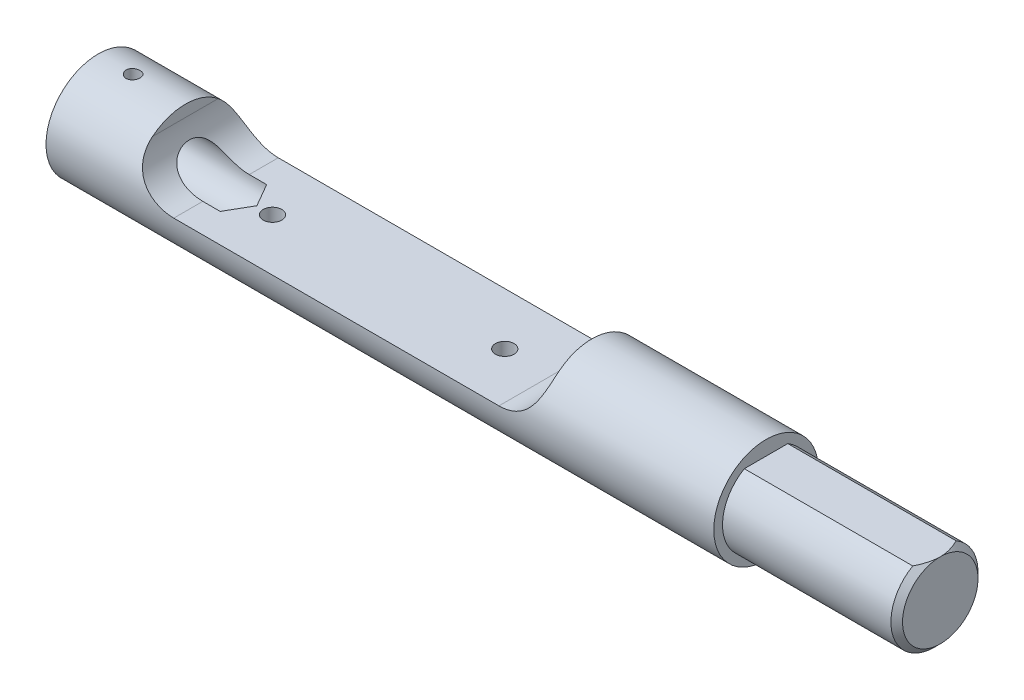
ISO-10303-21;
HEADER;
FILE_DESCRIPTION(('STEP AP214'),'2;1');
FILE_NAME('part.step','',(''),(''),'','','');
FILE_SCHEMA(('AUTOMOTIVE_DESIGN { 1 0 10303 214 1 1 1 1 }'));
ENDSEC;
DATA;
#1=APPLICATION_CONTEXT('core data for automotive mechanical design processes');
#2=APPLICATION_PROTOCOL_DEFINITION('international standard','automotive_design',2000,#1);
#3=PRODUCT_CONTEXT('',#1,'mechanical');
#4=PRODUCT('Part','Part','',(#3));
#5=PRODUCT_RELATED_PRODUCT_CATEGORY('part','',(#4));
#6=PRODUCT_DEFINITION_FORMATION('','',#4);
#7=PRODUCT_DEFINITION_CONTEXT('part definition',#1,'design');
#8=PRODUCT_DEFINITION('design','',#6,#7);
#9=PRODUCT_DEFINITION_SHAPE('','',#8);
#10=(LENGTH_UNIT() NAMED_UNIT(*) SI_UNIT(.MILLI.,.METRE.));
#11=(NAMED_UNIT(*) PLANE_ANGLE_UNIT() SI_UNIT($,.RADIAN.));
#12=(NAMED_UNIT(*) SI_UNIT($,.STERADIAN.) SOLID_ANGLE_UNIT());
#13=UNCERTAINTY_MEASURE_WITH_UNIT(LENGTH_MEASURE(1.E-05),#10,'distance_accuracy_value','');
#14=(GEOMETRIC_REPRESENTATION_CONTEXT(3) GLOBAL_UNCERTAINTY_ASSIGNED_CONTEXT((#13)) GLOBAL_UNIT_ASSIGNED_CONTEXT((#10,
#11,#12)) REPRESENTATION_CONTEXT('',''));
#15=CARTESIAN_POINT('',(0.,0.,0.));
#16=DIRECTION('',(0.,0.,1.));
#17=DIRECTION('',(1.,0.,0.));
#18=AXIS2_PLACEMENT_3D('',#15,#16,#17);
#19=CARTESIAN_POINT('',(0.,0.,0.));
#20=DIRECTION('',(-1.,0.,0.));
#21=DIRECTION('',(0.,0.,1.));
#22=AXIS2_PLACEMENT_3D('',#19,#20,#21);
#23=CYLINDRICAL_SURFACE('',#22,9.);
#24=CARTESIAN_POINT('',(68.4,-8.99999999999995,0.));
#25=CARTESIAN_POINT('',(68.4000034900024,-8.99999842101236,0.0891199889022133));
#26=CARTESIAN_POINT('',(68.4074711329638,-8.99866254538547,0.178286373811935));
#27=CARTESIAN_POINT('',(68.4371284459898,-8.99346217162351,0.354112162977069));
#28=CARTESIAN_POINT('',(68.459331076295,-8.98959544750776,0.440769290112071));
#29=CARTESIAN_POINT('',(68.5177617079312,-8.97976647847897,0.609007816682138));
#30=CARTESIAN_POINT('',(68.5539776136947,-8.97380604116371,0.690593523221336));
#31=CARTESIAN_POINT('',(68.6393736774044,-8.96044267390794,0.846521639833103));
#32=CARTESIAN_POINT('',(68.6885525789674,-8.95303988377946,0.920864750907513));
#33=CARTESIAN_POINT('',(68.7990438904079,-8.93752107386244,1.06101042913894));
#34=CARTESIAN_POINT('',(68.8604692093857,-8.92939884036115,1.12672329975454));
#35=CARTESIAN_POINT('',(68.9934667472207,-8.91340337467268,1.24696773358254));
#36=CARTESIAN_POINT('',(69.0650396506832,-8.90553015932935,1.30149854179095));
#37=CARTESIAN_POINT('',(69.2169261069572,-8.89086390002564,1.39819750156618));
#38=CARTESIAN_POINT('',(69.2972978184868,-8.88407887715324,1.44027562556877));
#39=CARTESIAN_POINT('',(69.4641098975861,-8.87244417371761,1.51029875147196));
#40=CARTESIAN_POINT('',(69.5505497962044,-8.86759434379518,1.53824484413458));
#41=CARTESIAN_POINT('',(69.7260889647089,-8.86044137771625,1.57892525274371));
#42=CARTESIAN_POINT('',(69.8151510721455,-8.85811219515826,1.59181525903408));
#43=CARTESIAN_POINT('',(69.9942020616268,-8.85618559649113,1.60250059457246));
#44=CARTESIAN_POINT('',(70.0841908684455,-8.856587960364,1.60029713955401));
#45=CARTESIAN_POINT('',(70.2614208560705,-8.86005524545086,1.58098461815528));
#46=CARTESIAN_POINT('',(70.348681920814,-8.86308872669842,1.56405155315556));
#47=CARTESIAN_POINT('',(70.5191045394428,-8.87142714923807,1.5160371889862));
#48=CARTESIAN_POINT('',(70.6022659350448,-8.87673217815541,1.48495534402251));
#49=CARTESIAN_POINT('',(70.7626492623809,-8.88904934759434,1.40935057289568));
#50=CARTESIAN_POINT('',(70.8398365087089,-8.89607059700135,1.36475561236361));
#51=CARTESIAN_POINT('',(70.9856989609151,-8.91102292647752,1.26344153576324));
#52=CARTESIAN_POINT('',(71.0543733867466,-8.91895408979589,1.20672130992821));
#53=CARTESIAN_POINT('',(71.1822785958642,-8.93497015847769,1.08181303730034));
#54=CARTESIAN_POINT('',(71.2413621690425,-8.94305565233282,1.01347422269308));
#55=CARTESIAN_POINT('',(71.3472472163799,-8.95836603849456,0.867775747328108));
#56=CARTESIAN_POINT('',(71.3940485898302,-8.96559092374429,0.790416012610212));
#57=CARTESIAN_POINT('',(71.4740583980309,-8.97837847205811,0.628725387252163));
#58=CARTESIAN_POINT('',(71.5072526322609,-8.98393939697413,0.544387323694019));
#59=CARTESIAN_POINT('',(71.5589629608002,-8.99275880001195,0.371211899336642));
#60=CARTESIAN_POINT('',(71.5774804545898,-8.99601749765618,0.282374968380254));
#61=CARTESIAN_POINT('',(71.5991093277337,-8.99983543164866,0.103991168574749));
#62=CARTESIAN_POINT('',(71.6024225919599,-9.00043003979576,0.0144695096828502));
#63=CARTESIAN_POINT('',(71.594088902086,-8.99895010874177,-0.163849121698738));
#64=CARTESIAN_POINT('',(71.5824426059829,-8.99687568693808,-0.252646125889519));
#65=CARTESIAN_POINT('',(71.5446882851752,-8.99031274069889,-0.426362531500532));
#66=CARTESIAN_POINT('',(71.5186813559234,-8.98584109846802,-0.511304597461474));
#67=CARTESIAN_POINT('',(71.4530526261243,-8.97498301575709,-0.675623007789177));
#68=CARTESIAN_POINT('',(71.4134299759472,-8.9685964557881,-0.754999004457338));
#69=CARTESIAN_POINT('',(71.3212402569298,-8.95452886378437,-0.906801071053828));
#70=CARTESIAN_POINT('',(71.2685485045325,-8.9468356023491,-0.979150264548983));
#71=CARTESIAN_POINT('',(71.1518863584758,-8.93104192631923,-1.11405184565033));
#72=CARTESIAN_POINT('',(71.0879150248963,-8.92294147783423,-1.17660341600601));
#73=CARTESIAN_POINT('',(70.949599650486,-8.90713046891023,-1.29089228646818));
#74=CARTESIAN_POINT('',(70.87514153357,-8.89942567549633,-1.34249245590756));
#75=CARTESIAN_POINT('',(70.7184955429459,-8.88539029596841,-1.4324527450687));
#76=CARTESIAN_POINT('',(70.6363079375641,-8.8790596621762,-1.47081332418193));
#77=CARTESIAN_POINT('',(70.4669010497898,-8.86853369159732,-1.53300592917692));
#78=CARTESIAN_POINT('',(70.3797064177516,-8.86432875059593,-1.55690340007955));
#79=CARTESIAN_POINT('',(70.2024587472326,-8.85850726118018,-1.5896953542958));
#80=CARTESIAN_POINT('',(70.1124059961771,-8.85689045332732,-1.59859134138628));
#81=CARTESIAN_POINT('',(69.9333698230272,-8.8564405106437,-1.60108148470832));
#82=CARTESIAN_POINT('',(69.8443894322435,-8.85756806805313,-1.59489171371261));
#83=CARTESIAN_POINT('',(69.6687584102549,-8.8623931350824,-1.56785629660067));
#84=CARTESIAN_POINT('',(69.5821077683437,-8.86609063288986,-1.54701071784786));
#85=CARTESIAN_POINT('',(69.4136964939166,-8.87562318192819,-1.49134260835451));
#86=CARTESIAN_POINT('',(69.3319286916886,-8.88145500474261,-1.45654117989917));
#87=CARTESIAN_POINT('',(69.1753575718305,-8.89460176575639,-1.37397214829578));
#88=CARTESIAN_POINT('',(69.1005546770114,-8.90191679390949,-1.32620375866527));
#89=CARTESIAN_POINT('',(68.9589498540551,-8.91732902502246,-1.21829594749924));
#90=CARTESIAN_POINT('',(68.8922693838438,-8.9254354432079,-1.1579984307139));
#91=CARTESIAN_POINT('',(68.7699001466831,-8.94144596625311,-1.02707564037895));
#92=CARTESIAN_POINT('',(68.7142139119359,-8.94935002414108,-0.956447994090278));
#93=CARTESIAN_POINT('',(68.6150030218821,-8.96413880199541,-0.806197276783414));
#94=CARTESIAN_POINT('',(68.5715788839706,-8.97101489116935,-0.726506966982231));
#95=CARTESIAN_POINT('',(68.4988028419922,-8.98288895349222,-0.560868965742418));
#96=CARTESIAN_POINT('',(68.4694373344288,-8.98788874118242,-0.474927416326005));
#97=CARTESIAN_POINT('',(68.4317735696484,-8.99439282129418,-0.323910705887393));
#98=CARTESIAN_POINT('',(68.4198782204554,-8.99648394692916,-0.259733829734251));
#99=CARTESIAN_POINT('',(68.4039902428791,-8.99928809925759,-0.130379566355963));
#100=CARTESIAN_POINT('',(68.3999974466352,-9.000001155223,-0.0652022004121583));
#101=CARTESIAN_POINT('',(68.4,-8.99999999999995,0.));
#102=B_SPLINE_CURVE_WITH_KNOTS('',3,(#24,#25,#26,#27,#28,#29,#30,#31,#32,#33,#34,#35,#36,#37,
#38,#39,#40,#41,#42,#43,#44,#45,#46,#47,#48,#49,#50,#51,#52,#53,#54,#55,#56,#57,#58,#59,#60,#61,
#62,#63,#64,#65,#66,#67,#68,#69,#70,#71,#72,#73,#74,#75,#76,#77,#78,#79,#80,#81,#82,#83,#84,#85,
#86,#87,#88,#89,#90,#91,#92,#93,#94,#95,#96,#97,#98,#99,#100,#101),.UNSPECIFIED.,.T.,.F.,(4,2,2,
2,2,2,2,2,2,2,2,2,2,2,2,2,2,2,2,2,2,2,2,2,2,2,2,2,2,2,2,2,2,2,2,2,2,2,4),(0.,0.267121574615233,
0.534478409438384,0.801604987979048,1.06870568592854,1.33839346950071,1.60809945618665,
1.8797101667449,2.151299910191,2.42005564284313,2.68878972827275,2.95435619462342,
3.21993290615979,3.48695100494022,3.75399355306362,4.02481082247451,4.29563031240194,
4.56673171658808,4.83780726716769,5.10527280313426,5.37272657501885,5.63832110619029,
5.90393221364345,6.17218198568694,6.44045412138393,6.71190959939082,6.98335565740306,
7.25356406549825,7.5237453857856,7.79007970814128,8.05641280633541,8.32234469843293,
8.58829272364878,8.85782605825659,9.12742139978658,9.39916649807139,9.67064811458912,
9.86608445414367,10.0615166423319),.UNSPECIFIED.);
#103=CARTESIAN_POINT('',(68.4,-8.99999999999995,0.));
#104=VERTEX_POINT('',#103);
#105=EDGE_CURVE('E204',#104,#104,#102,.T.);
#106=ORIENTED_EDGE('',*,*,#105,.T.);
#107=EDGE_LOOP('',(#106));
#108=FACE_BOUND('',#107,.T.);
#109=CARTESIAN_POINT('',(28.4,-8.99999999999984,0.));
#110=CARTESIAN_POINT('',(28.4000034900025,-8.99999842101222,0.089119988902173));
#111=CARTESIAN_POINT('',(28.4074711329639,-8.9986625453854,0.178286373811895));
#112=CARTESIAN_POINT('',(28.4371284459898,-8.99346217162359,0.354112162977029));
#113=CARTESIAN_POINT('',(28.459331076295,-8.98959544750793,0.440769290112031));
#114=CARTESIAN_POINT('',(28.5177617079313,-8.97976647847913,0.609007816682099));
#115=CARTESIAN_POINT('',(28.5539776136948,-8.97380604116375,0.690593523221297));
#116=CARTESIAN_POINT('',(28.6393736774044,-8.9604426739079,0.846521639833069));
#117=CARTESIAN_POINT('',(28.6885525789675,-8.95303988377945,0.920864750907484));
#118=CARTESIAN_POINT('',(28.799043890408,-8.93752107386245,1.06101042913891));
#119=CARTESIAN_POINT('',(28.8604692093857,-8.92939884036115,1.12672329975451));
#120=CARTESIAN_POINT('',(28.9934667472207,-8.91340337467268,1.24696773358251));
#121=CARTESIAN_POINT('',(29.0650396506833,-8.90553015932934,1.30149854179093));
#122=CARTESIAN_POINT('',(29.2169261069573,-8.89086390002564,1.39819750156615));
#123=CARTESIAN_POINT('',(29.2972978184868,-8.88407887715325,1.44027562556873));
#124=CARTESIAN_POINT('',(29.4641098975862,-8.87244417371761,1.51029875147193));
#125=CARTESIAN_POINT('',(29.5505497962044,-8.86759434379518,1.53824484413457));
#126=CARTESIAN_POINT('',(29.7260889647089,-8.86044137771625,1.57892525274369));
#127=CARTESIAN_POINT('',(29.8151510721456,-8.85811219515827,1.59181525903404));
#128=CARTESIAN_POINT('',(29.9942020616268,-8.85618559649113,1.60250059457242));
#129=CARTESIAN_POINT('',(30.0841908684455,-8.856587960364,1.60029713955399));
#130=CARTESIAN_POINT('',(30.2614208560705,-8.86005524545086,1.58098461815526));
#131=CARTESIAN_POINT('',(30.3486819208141,-8.86308872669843,1.56405155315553));
#132=CARTESIAN_POINT('',(30.5191045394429,-8.87142714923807,1.51603718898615));
#133=CARTESIAN_POINT('',(30.6022659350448,-8.87673217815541,1.48495534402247));
#134=CARTESIAN_POINT('',(30.7626492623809,-8.88904934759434,1.40935057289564));
#135=CARTESIAN_POINT('',(30.8398365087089,-8.89607059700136,1.36475561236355));
#136=CARTESIAN_POINT('',(30.9856989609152,-8.91102292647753,1.26344153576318));
#137=CARTESIAN_POINT('',(31.0543733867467,-8.91895408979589,1.20672130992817));
#138=CARTESIAN_POINT('',(31.1822785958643,-8.93497015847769,1.0818130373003));
#139=CARTESIAN_POINT('',(31.2413621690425,-8.94305565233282,1.01347422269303));
#140=CARTESIAN_POINT('',(31.3472472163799,-8.95836603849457,0.867775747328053));
#141=CARTESIAN_POINT('',(31.3940485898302,-8.9655909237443,0.790416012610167));
#142=CARTESIAN_POINT('',(31.474058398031,-8.97837847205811,0.628725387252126));
#143=CARTESIAN_POINT('',(31.5072526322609,-8.98393939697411,0.54438732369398));
#144=CARTESIAN_POINT('',(31.5589629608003,-8.99275880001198,0.371211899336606));
#145=CARTESIAN_POINT('',(31.5774804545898,-8.99601749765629,0.282374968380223));
#146=CARTESIAN_POINT('',(31.5991093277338,-8.99983543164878,0.103991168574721));
#147=CARTESIAN_POINT('',(31.6024225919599,-9.00043003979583,0.0144695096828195));
#148=CARTESIAN_POINT('',(31.594088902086,-8.99895010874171,-0.163849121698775));
#149=CARTESIAN_POINT('',(31.582442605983,-8.99687568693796,-0.252646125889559));
#150=CARTESIAN_POINT('',(31.5446882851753,-8.99031274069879,-0.426362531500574));
#151=CARTESIAN_POINT('',(31.5186813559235,-8.98584109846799,-0.511304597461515));
#152=CARTESIAN_POINT('',(31.4530526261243,-8.97498301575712,-0.675623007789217));
#153=CARTESIAN_POINT('',(31.4134299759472,-8.96859645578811,-0.75499900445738));
#154=CARTESIAN_POINT('',(31.3212402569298,-8.95452886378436,-0.906801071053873));
#155=CARTESIAN_POINT('',(31.2685485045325,-8.94683560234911,-0.97915026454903));
#156=CARTESIAN_POINT('',(31.1518863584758,-8.93104192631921,-1.11405184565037));
#157=CARTESIAN_POINT('',(31.0879150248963,-8.92294147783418,-1.17660341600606));
#158=CARTESIAN_POINT('',(30.9495996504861,-8.90713046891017,-1.29089228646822));
#159=CARTESIAN_POINT('',(30.87514153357,-8.8994256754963,-1.3424924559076));
#160=CARTESIAN_POINT('',(30.7184955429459,-8.88539029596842,-1.43245274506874));
#161=CARTESIAN_POINT('',(30.6363079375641,-8.8790596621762,-1.47081332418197));
#162=CARTESIAN_POINT('',(30.4669010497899,-8.86853369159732,-1.53300592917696));
#163=CARTESIAN_POINT('',(30.3797064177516,-8.86432875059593,-1.55690340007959));
#164=CARTESIAN_POINT('',(30.2024587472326,-8.85850726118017,-1.58969535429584));
#165=CARTESIAN_POINT('',(30.1124059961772,-8.85689045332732,-1.59859134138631));
#166=CARTESIAN_POINT('',(29.9333698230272,-8.85644051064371,-1.60108148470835));
#167=CARTESIAN_POINT('',(29.8443894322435,-8.85756806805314,-1.59489171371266));
#168=CARTESIAN_POINT('',(29.668758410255,-8.86239313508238,-1.56785629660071));
#169=CARTESIAN_POINT('',(29.5821077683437,-8.8660906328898,-1.54701071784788));
#170=CARTESIAN_POINT('',(29.4136964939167,-8.87562318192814,-1.49134260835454));
#171=CARTESIAN_POINT('',(29.3319286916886,-8.8814550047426,-1.45654117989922));
#172=CARTESIAN_POINT('',(29.1753575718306,-8.89460176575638,-1.37397214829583));
#173=CARTESIAN_POINT('',(29.1005546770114,-8.90191679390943,-1.32620375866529));
#174=CARTESIAN_POINT('',(28.9589498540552,-8.9173290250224,-1.21829594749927));
#175=CARTESIAN_POINT('',(28.8922693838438,-8.92543544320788,-1.15799843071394));
#176=CARTESIAN_POINT('',(28.7699001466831,-8.94144596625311,-1.027075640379));
#177=CARTESIAN_POINT('',(28.714213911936,-8.94935002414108,-0.956447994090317));
#178=CARTESIAN_POINT('',(28.6150030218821,-8.96413880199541,-0.806197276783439));
#179=CARTESIAN_POINT('',(28.5715788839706,-8.97101489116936,-0.726506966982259));
#180=CARTESIAN_POINT('',(28.4988028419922,-8.9828889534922,-0.560868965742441));
#181=CARTESIAN_POINT('',(28.4694373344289,-8.98788874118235,-0.474927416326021));
#182=CARTESIAN_POINT('',(28.4317735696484,-8.99439282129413,-0.323910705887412));
#183=CARTESIAN_POINT('',(28.4198782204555,-8.99648394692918,-0.259733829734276));
#184=CARTESIAN_POINT('',(28.4039902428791,-8.99928809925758,-0.130379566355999));
#185=CARTESIAN_POINT('',(28.3999974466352,-9.00000115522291,-0.0652022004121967));
#186=CARTESIAN_POINT('',(28.4,-8.99999999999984,0.));
#187=B_SPLINE_CURVE_WITH_KNOTS('',3,(#109,#110,#111,#112,#113,#114,#115,#116,#117,#118,#119,
#120,#121,#122,#123,#124,#125,#126,#127,#128,#129,#130,#131,#132,#133,#134,#135,#136,#137,#138,
#139,#140,#141,#142,#143,#144,#145,#146,#147,#148,#149,#150,#151,#152,#153,#154,#155,#156,#157,
#158,#159,#160,#161,#162,#163,#164,#165,#166,#167,#168,#169,#170,#171,#172,#173,#174,#175,#176,
#177,#178,#179,#180,#181,#182,#183,#184,#185,#186),.UNSPECIFIED.,.T.,.F.,(4,2,2,2,2,2,2,2,2,2,2,
2,2,2,2,2,2,2,2,2,2,2,2,2,2,2,2,2,2,2,2,2,2,2,2,2,2,2,4),(0.,0.267121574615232,
0.534478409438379,0.801604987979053,1.06870568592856,1.33839346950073,1.60809945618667,
1.87971016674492,2.15129991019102,2.42005564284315,2.68878972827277,2.95435619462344,
3.21993290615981,3.48695100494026,3.75399355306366,4.02481082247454,4.29563031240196,
4.5667317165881,4.8378072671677,5.10527280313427,5.37272657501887,5.63832110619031,
5.90393221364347,6.17218198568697,6.44045412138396,6.71190959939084,6.98335565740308,
7.25356406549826,7.52374538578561,7.79007970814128,8.05641280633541,8.32234469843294,
8.58829272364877,8.85782605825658,9.12742139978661,9.39916649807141,9.67064811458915,
9.86608445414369,10.0615166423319),.UNSPECIFIED.);
#188=CARTESIAN_POINT('',(28.4,-8.99999999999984,0.));
#189=VERTEX_POINT('',#188);
#190=EDGE_CURVE('E129',#189,#189,#187,.T.);
#191=ORIENTED_EDGE('',*,*,#190,.T.);
#192=EDGE_LOOP('',(#191));
#193=FACE_BOUND('',#192,.T.);
#194=CARTESIAN_POINT('',(78.,0.,8.99999999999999));
#195=CARTESIAN_POINT('',(77.8046050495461,1.14168892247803E-06,9.00000144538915));
#196=CARTESIAN_POINT('',(77.6091559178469,0.00818897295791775,9.00001156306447));
#197=CARTESIAN_POINT('',(77.2195466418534,0.0408948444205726,8.99992151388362));
#198=CARTESIAN_POINT('',(77.0253872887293,0.0654221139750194,8.99982128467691));
#199=CARTESIAN_POINT('',(76.6393486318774,0.13071821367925,8.99911004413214));
#200=CARTESIAN_POINT('',(76.4474756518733,0.171524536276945,8.9984978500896));
#201=CARTESIAN_POINT('',(76.0678641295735,0.269082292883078,8.99610872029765));
#202=CARTESIAN_POINT('',(75.8801250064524,0.325831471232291,8.99433194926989));
#203=CARTESIAN_POINT('',(75.5100838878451,0.454871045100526,8.98872962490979));
#204=CARTESIAN_POINT('',(75.3277821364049,0.527162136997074,8.98490397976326));
#205=CARTESIAN_POINT('',(74.9699482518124,0.686746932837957,8.97411672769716));
#206=CARTESIAN_POINT('',(74.7944164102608,0.774041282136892,8.9671549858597));
#207=CARTESIAN_POINT('',(74.4515588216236,0.962877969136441,8.94884656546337));
#208=CARTESIAN_POINT('',(74.2842282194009,1.06441173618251,8.93750251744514));
#209=CARTESIAN_POINT('',(73.9589831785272,1.28087974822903,8.90905479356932));
#210=CARTESIAN_POINT('',(73.8010683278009,1.39581340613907,8.89195136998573));
#211=CARTESIAN_POINT('',(73.4996561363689,1.63501946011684,8.8510489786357));
#212=CARTESIAN_POINT('',(73.3559017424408,1.75899715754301,8.82742276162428));
#213=CARTESIAN_POINT('',(73.0797425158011,2.01734893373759,8.771986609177));
#214=CARTESIAN_POINT('',(72.947337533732,2.15172287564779,8.74017678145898));
#215=CARTESIAN_POINT('',(72.6950307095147,2.42917608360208,8.66715973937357));
#216=CARTESIAN_POINT('',(72.5751190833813,2.57224839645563,8.6259599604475));
#217=CARTESIAN_POINT('',(72.3485615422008,2.86532501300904,8.53308416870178));
#218=CARTESIAN_POINT('',(72.2419142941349,3.01532861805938,8.48140920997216));
#219=CARTESIAN_POINT('',(72.051469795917,3.30642872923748,8.37194648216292));
#220=CARTESIAN_POINT('',(71.966479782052,3.44711131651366,8.3151278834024));
#221=CARTESIAN_POINT('',(71.8081908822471,3.7307685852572,8.19178097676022));
#222=CARTESIAN_POINT('',(71.7348911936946,3.87374310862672,8.12525333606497));
#223=CARTESIAN_POINT('',(71.5999327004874,4.16024363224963,7.98235533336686));
#224=CARTESIAN_POINT('',(71.5382731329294,4.30376959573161,7.90598561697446));
#225=CARTESIAN_POINT('',(71.4262616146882,4.5897006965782,7.74349316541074));
#226=CARTESIAN_POINT('',(71.375909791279,4.73210582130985,7.65737032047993));
#227=CARTESIAN_POINT('',(71.2873893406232,5.00967479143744,7.47860468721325));
#228=CARTESIAN_POINT('',(71.2488799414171,5.14492400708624,7.38626205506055));
#229=CARTESIAN_POINT('',(71.1811959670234,5.41165325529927,7.19313013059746));
#230=CARTESIAN_POINT('',(71.1520211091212,5.5431334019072,7.0923410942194));
#231=CARTESIAN_POINT('',(71.1021477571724,5.80128258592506,6.88278773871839));
#232=CARTESIAN_POINT('',(71.0814509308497,5.92795067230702,6.77402185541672));
#233=CARTESIAN_POINT('',(71.0475937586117,6.17557924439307,6.54906200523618));
#234=CARTESIAN_POINT('',(71.0344345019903,6.29653890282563,6.4328669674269));
#235=CARTESIAN_POINT('',(71.0134400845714,6.54656457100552,6.17883876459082));
#236=CARTESIAN_POINT('',(71.0064627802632,6.67478776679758,6.04010521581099));
#237=CARTESIAN_POINT('',(70.9993355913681,6.92232169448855,5.75475020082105));
#238=CARTESIAN_POINT('',(70.9991861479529,7.04163184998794,5.60812822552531));
#239=CARTESIAN_POINT('',(71.0043006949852,7.27080934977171,5.30764141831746));
#240=CARTESIAN_POINT('',(71.0095680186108,7.380670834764,5.15377218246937));
#241=CARTESIAN_POINT('',(71.0241513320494,7.59041352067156,4.8395572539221));
#242=CARTESIAN_POINT('',(71.0334677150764,7.69029375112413,4.67921093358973));
#243=CARTESIAN_POINT('',(71.0570894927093,7.89961349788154,4.31836443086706));
#244=CARTESIAN_POINT('',(71.0720319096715,8.00665024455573,4.11650783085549));
#245=CARTESIAN_POINT('',(71.1037688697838,8.2050269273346,3.70535404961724));
#246=CARTESIAN_POINT('',(71.1205636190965,8.29636511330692,3.49605604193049));
#247=CARTESIAN_POINT('',(71.1540435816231,8.46290879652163,3.07103905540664));
#248=CARTESIAN_POINT('',(71.1707287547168,8.53810867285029,2.85531786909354));
#249=CARTESIAN_POINT('',(71.2022505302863,8.67192348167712,2.41865532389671));
#250=CARTESIAN_POINT('',(71.2170870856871,8.73053799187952,2.19771383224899));
#251=CARTESIAN_POINT('',(71.2448984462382,8.83628135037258,1.72752170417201));
#252=CARTESIAN_POINT('',(71.2574947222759,8.88146507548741,1.47780775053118));
#253=CARTESIAN_POINT('',(71.2771698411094,8.95060245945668,0.975224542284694));
#254=CARTESIAN_POINT('',(71.2842483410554,8.97455479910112,0.722355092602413));
#255=CARTESIAN_POINT('',(71.2920789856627,9.00099698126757,0.215481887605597));
#256=CARTESIAN_POINT('',(71.2928333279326,9.00349427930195,-0.0385214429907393));
#257=CARTESIAN_POINT('',(71.2879344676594,8.98702035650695,-0.545758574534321));
#258=CARTESIAN_POINT('',(71.2822815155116,8.96804997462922,-0.798992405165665));
#259=CARTESIAN_POINT('',(71.2655388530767,8.90994763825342,-1.29320569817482));
#260=CARTESIAN_POINT('',(71.2546631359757,8.87160639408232,-1.53428606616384));
#261=CARTESIAN_POINT('',(71.2287412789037,8.7755354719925,-2.01231568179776));
#262=CARTESIAN_POINT('',(71.213695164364,8.7178059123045,-2.24926495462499));
#263=CARTESIAN_POINT('',(71.1810599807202,8.58330184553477,-2.71779357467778));
#264=CARTESIAN_POINT('',(71.1634681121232,8.50650630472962,-2.94936668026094));
#265=CARTESIAN_POINT('',(71.1278010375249,8.33439117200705,-3.40548754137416));
#266=CARTESIAN_POINT('',(71.1097258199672,8.23907113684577,-3.63003512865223));
#267=CARTESIAN_POINT('',(71.0748917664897,8.02703139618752,-4.07801080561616));
#268=CARTESIAN_POINT('',(71.0581955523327,7.90971234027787,-4.30116060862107));
#269=CARTESIAN_POINT('',(71.0296982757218,7.65658962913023,-4.73710487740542));
#270=CARTESIAN_POINT('',(71.0178977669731,7.52078388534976,-4.9498981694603));
#271=CARTESIAN_POINT('',(71.0023461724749,7.23182526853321,-5.36322566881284));
#272=CARTESIAN_POINT('',(70.9985828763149,7.07869908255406,-5.56377802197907));
#273=CARTESIAN_POINT('',(71.0023906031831,6.75620545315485,-5.95123029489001));
#274=CARTESIAN_POINT('',(71.0099572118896,6.58684435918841,-6.13813550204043));
#275=CARTESIAN_POINT('',(71.0358284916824,6.2808399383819,-6.44865049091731));
#276=CARTESIAN_POINT('',(71.0507288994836,6.14752590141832,-6.57584133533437));
#277=CARTESIAN_POINT('',(71.0897581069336,5.87411629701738,-6.82117769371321));
#278=CARTESIAN_POINT('',(71.1138846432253,5.73402240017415,-6.93932541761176));
#279=CARTESIAN_POINT('',(71.1725828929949,5.44834962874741,-7.16579974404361));
#280=CARTESIAN_POINT('',(71.2071468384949,5.30277490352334,-7.27413357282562));
#281=CARTESIAN_POINT('',(71.2878145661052,5.00751880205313,-7.48045363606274));
#282=CARTESIAN_POINT('',(71.3339185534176,4.85783735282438,-7.57843968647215));
#283=CARTESIAN_POINT('',(71.4388506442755,4.55518475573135,-7.76414861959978));
#284=CARTESIAN_POINT('',(71.4977549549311,4.40219907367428,-7.85180496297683));
#285=CARTESIAN_POINT('',(71.6287002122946,4.09581551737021,-8.01589014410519));
#286=CARTESIAN_POINT('',(71.7007411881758,3.94241764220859,-8.09231895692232));
#287=CARTESIAN_POINT('',(71.8581864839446,3.6373238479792,-8.23396411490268));
#288=CARTESIAN_POINT('',(71.9435899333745,3.4856278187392,-8.29918118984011));
#289=CARTESIAN_POINT('',(72.1276396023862,3.18604118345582,-8.41873831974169));
#290=CARTESIAN_POINT('',(72.2262849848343,3.0381503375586,-8.47307906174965));
#291=CARTESIAN_POINT('',(72.4263168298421,2.76204207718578,-8.56681468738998));
#292=CARTESIAN_POINT('',(72.5265404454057,2.633295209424,-8.60714159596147));
#293=CARTESIAN_POINT('',(72.7369337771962,2.38188346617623,-8.68007862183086));
#294=CARTESIAN_POINT('',(72.8471037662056,2.25921875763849,-8.71268852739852));
#295=CARTESIAN_POINT('',(73.0767454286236,2.02115239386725,-8.77097306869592));
#296=CARTESIAN_POINT('',(73.1962180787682,1.90575150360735,-8.79664697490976));
#297=CARTESIAN_POINT('',(73.4437198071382,1.68323330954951,-8.84192405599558));
#298=CARTESIAN_POINT('',(73.571749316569,1.57611642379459,-8.86152692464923));
#299=CARTESIAN_POINT('',(73.8403382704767,1.36731101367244,-8.89618264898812));
#300=CARTESIAN_POINT('',(73.9811833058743,1.26595848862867,-8.91104550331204));
#301=CARTESIAN_POINT('',(74.270350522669,1.07379828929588,-8.93623827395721));
#302=CARTESIAN_POINT('',(74.4186757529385,0.982994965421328,-8.94656632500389));
#303=CARTESIAN_POINT('',(74.7218694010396,0.812584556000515,-8.96365126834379));
#304=CARTESIAN_POINT('',(74.8767395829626,0.732980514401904,-8.970407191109));
#305=CARTESIAN_POINT('',(75.1919971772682,0.585532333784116,-8.98123685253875));
#306=CARTESIAN_POINT('',(75.3523826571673,0.517684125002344,-8.98531152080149));
#307=CARTESIAN_POINT('',(75.692365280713,0.388587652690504,-8.99186020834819));
#308=CARTESIAN_POINT('',(75.8723973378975,0.328473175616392,-8.99415837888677));
#309=CARTESIAN_POINT('',(76.2367629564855,0.223056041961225,-8.99739006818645));
#310=CARTESIAN_POINT('',(76.421096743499,0.177754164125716,-8.99832351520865));
#311=CARTESIAN_POINT('',(76.7928616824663,0.102261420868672,-8.999498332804));
#312=CARTESIAN_POINT('',(76.9802932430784,0.0720725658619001,-8.99973961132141));
#313=CARTESIAN_POINT('',(77.3569881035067,0.0270149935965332,-8.99998765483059));
#314=CARTESIAN_POINT('',(77.546251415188,0.0121463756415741,-8.99999441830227));
#315=CARTESIAN_POINT('',(77.9320805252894,-0.00242540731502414,-9.00000296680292));
#316=CARTESIAN_POINT('',(78.1286675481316,-0.00157279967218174,-9.00000456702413));
#317=CARTESIAN_POINT('',(78.5210778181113,0.0166583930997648,-8.99998911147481));
#318=CARTESIAN_POINT('',(78.7169010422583,0.0340374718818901,-8.999972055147));
#319=CARTESIAN_POINT('',(79.106428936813,0.0852036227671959,-8.9996329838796));
#320=CARTESIAN_POINT('',(79.3001332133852,0.118993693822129,-8.99931091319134));
#321=CARTESIAN_POINT('',(79.6840108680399,0.20274310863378,-8.99781345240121));
#322=CARTESIAN_POINT('',(79.87418425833,0.252702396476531,-8.99663806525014));
#323=CARTESIAN_POINT('',(80.2499999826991,0.368541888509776,-8.99263806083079));
#324=CARTESIAN_POINT('',(80.4356330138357,0.434452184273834,-8.98981031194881));
#325=CARTESIAN_POINT('',(80.8006415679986,0.581656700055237,-8.98148687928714));
#326=CARTESIAN_POINT('',(80.9800170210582,0.662951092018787,-8.97599116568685));
#327=CARTESIAN_POINT('',(81.331166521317,0.840290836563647,-8.96112855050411));
#328=CARTESIAN_POINT('',(81.5029404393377,0.936336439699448,-8.95176158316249));
#329=CARTESIAN_POINT('',(81.8375399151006,1.14236546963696,-8.92780771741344));
#330=CARTESIAN_POINT('',(82.0003657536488,1.25234845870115,-8.91322098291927));
#331=CARTESIAN_POINT('',(82.3121975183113,1.48260332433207,-8.87778927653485));
#332=CARTESIAN_POINT('',(82.4614318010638,1.60258839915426,-8.85709232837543));
#333=CARTESIAN_POINT('',(82.7488783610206,1.85368423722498,-8.80796299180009));
#334=CARTESIAN_POINT('',(82.8870907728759,1.98479486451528,-8.77953069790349));
#335=CARTESIAN_POINT('',(83.1512479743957,2.25652924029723,-8.71364425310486));
#336=CARTESIAN_POINT('',(83.2772035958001,2.39714439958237,-8.67619817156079));
#337=CARTESIAN_POINT('',(83.5160019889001,2.68620190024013,-8.59110012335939));
#338=CARTESIAN_POINT('',(83.6288460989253,2.83464344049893,-8.54344919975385));
#339=CARTESIAN_POINT('',(83.8314760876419,3.12413334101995,-8.44163758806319));
#340=CARTESIAN_POINT('',(83.9224136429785,3.26470281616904,-8.38840274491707));
#341=CARTESIAN_POINT('',(84.0924197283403,3.54893655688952,-8.27215902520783));
#342=CARTESIAN_POINT('',(84.1714890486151,3.69260061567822,-8.20915079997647));
#343=CARTESIAN_POINT('',(84.3176853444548,3.98122178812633,-8.07312329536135));
#344=CARTESIAN_POINT('',(84.3848140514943,4.12617871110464,-8.00010547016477));
#345=CARTESIAN_POINT('',(84.5073642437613,4.41564038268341,-7.84405201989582));
#346=CARTESIAN_POINT('',(84.5627857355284,4.56014513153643,-7.76101640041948));
#347=CARTESIAN_POINT('',(84.6601479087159,4.84049917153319,-7.58916094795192));
#348=CARTESIAN_POINT('',(84.7025872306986,4.97644312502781,-7.50077620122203));
#349=CARTESIAN_POINT('',(84.777886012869,5.24508613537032,-7.31544260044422));
#350=CARTESIAN_POINT('',(84.810745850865,5.37778532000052,-7.21849408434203));
#351=CARTESIAN_POINT('',(84.8676834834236,5.6388322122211,-7.01646774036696));
#352=CARTESIAN_POINT('',(84.8917595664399,5.76717906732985,-6.91138833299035));
#353=CARTESIAN_POINT('',(84.9320257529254,6.01855820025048,-6.69362534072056));
#354=CARTESIAN_POINT('',(84.9482147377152,6.14158972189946,-6.58094067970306));
#355=CARTESIAN_POINT('',(84.9750446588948,6.39450532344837,-6.33597247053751));
#356=CARTESIAN_POINT('',(84.9848979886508,6.52369533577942,-6.20288638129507));
#357=CARTESIAN_POINT('',(84.9974628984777,6.77374931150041,-5.9288062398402));
#358=CARTESIAN_POINT('',(85.0001740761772,6.89461280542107,-5.78781174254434));
#359=CARTESIAN_POINT('',(84.9998085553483,7.12743991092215,-5.49855337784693));
#360=CARTESIAN_POINT('',(84.9967287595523,7.23939872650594,-5.35028566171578));
#361=CARTESIAN_POINT('',(84.986095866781,7.45386563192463,-5.04721319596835));
#362=CARTESIAN_POINT('',(84.978542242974,7.55637260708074,-4.89240767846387));
#363=CARTESIAN_POINT('',(84.9583210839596,7.7718817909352,-4.54401683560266));
#364=CARTESIAN_POINT('',(84.9449160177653,7.882621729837,-4.34907112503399));
#365=CARTESIAN_POINT('',(84.9155302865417,8.08918663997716,-3.95161182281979));
#366=CARTESIAN_POINT('',(84.899549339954,8.18500997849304,-3.74909740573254));
#367=CARTESIAN_POINT('',(84.8669382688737,8.36132443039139,-3.33742625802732));
#368=CARTESIAN_POINT('',(84.8503078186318,8.44180772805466,-3.12826620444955));
#369=CARTESIAN_POINT('',(84.8181407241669,8.58697328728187,-2.70445332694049));
#370=CARTESIAN_POINT('',(84.8026040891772,8.65165541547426,-2.48980045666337));
#371=CARTESIAN_POINT('',(84.7722906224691,8.7721282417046,-2.02822871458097));
#372=CARTESIAN_POINT('',(84.7578675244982,8.82571073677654,-1.78070591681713));
#373=CARTESIAN_POINT('',(84.7340042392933,8.91185482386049,-1.28177150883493));
#374=CARTESIAN_POINT('',(84.7245644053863,8.94441492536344,-1.0303596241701));
#375=CARTESIAN_POINT('',(84.7117481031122,8.98820585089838,-0.525632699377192));
#376=CARTESIAN_POINT('',(84.708369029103,8.99944584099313,-0.272318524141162));
#377=CARTESIAN_POINT('',(84.7080507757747,9.00051411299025,0.234349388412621));
#378=CARTESIAN_POINT('',(84.711111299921,8.9903433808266,0.487703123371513));
#379=CARTESIAN_POINT('',(84.7231190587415,8.94938451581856,0.984109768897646));
#380=CARTESIAN_POINT('',(84.7318674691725,8.91929213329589,1.22722539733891));
#381=CARTESIAN_POINT('',(84.7541206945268,8.83944744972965,1.70997878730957));
#382=CARTESIAN_POINT('',(84.7676255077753,8.78969515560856,1.94961655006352));
#383=CARTESIAN_POINT('',(84.7979417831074,8.67085163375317,2.42408964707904));
#384=CARTESIAN_POINT('',(84.8147566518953,8.60174045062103,2.65891975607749));
#385=CARTESIAN_POINT('',(84.8497739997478,8.4446676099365,3.12208121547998));
#386=CARTESIAN_POINT('',(84.8679765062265,8.35670557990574,3.35041243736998));
#387=CARTESIAN_POINT('',(84.903931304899,8.16014972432,3.80455259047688));
#388=CARTESIAN_POINT('',(84.9216626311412,8.05111543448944,4.03017276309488));
#389=CARTESIAN_POINT('',(84.9534795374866,7.81447557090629,4.47176948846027));
#390=CARTESIAN_POINT('',(84.9675647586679,7.68686817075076,4.68774509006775));
#391=CARTESIAN_POINT('',(84.9890812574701,7.41405508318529,5.10828048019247));
#392=CARTESIAN_POINT('',(84.9965206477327,7.26887109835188,5.31285390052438));
#393=CARTESIAN_POINT('',(85.0015778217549,6.96186524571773,5.70922136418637));
#394=CARTESIAN_POINT('',(84.9991988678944,6.80004892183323,5.90101963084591));
#395=CARTESIAN_POINT('',(84.9835029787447,6.5029656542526,6.22472061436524));
#396=CARTESIAN_POINT('',(84.9730185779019,6.37095051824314,6.35975695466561));
#397=CARTESIAN_POINT('',(84.9431467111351,6.0992313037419,6.62078869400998));
#398=CARTESIAN_POINT('',(84.9237613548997,5.9595290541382,6.74678622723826));
#399=CARTESIAN_POINT('',(84.8747255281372,5.67366724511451,6.98888790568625));
#400=CARTESIAN_POINT('',(84.8450827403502,5.52751258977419,7.10499937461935));
#401=CARTESIAN_POINT('',(84.7742707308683,5.23007919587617,7.32670942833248));
#402=CARTESIAN_POINT('',(84.7331013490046,5.07880038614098,7.43230786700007));
#403=CARTESIAN_POINT('',(84.6378433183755,4.77176111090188,7.63309753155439));
#404=CARTESIAN_POINT('',(84.5836648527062,4.61597642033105,7.72820938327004));
#405=CARTESIAN_POINT('',(84.4617627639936,4.3029982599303,7.90674794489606));
#406=CARTESIAN_POINT('',(84.3940391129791,4.14580478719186,7.99017463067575));
#407=CARTESIAN_POINT('',(84.2446433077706,3.83225975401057,8.14520532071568));
#408=CARTESIAN_POINT('',(84.1629741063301,3.67590802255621,8.21681182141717));
#409=CARTESIAN_POINT('',(83.9856509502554,3.36629712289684,8.34843332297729));
#410=CARTESIAN_POINT('',(83.8899981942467,3.21303769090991,8.40844931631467));
#411=CARTESIAN_POINT('',(83.6965250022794,2.92866155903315,8.51135701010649));
#412=CARTESIAN_POINT('',(83.6001411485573,2.79698423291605,8.55541283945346));
#413=CARTESIAN_POINT('',(83.3970747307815,2.53922659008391,8.63542350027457));
#414=CARTESIAN_POINT('',(83.2903920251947,2.41314635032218,8.67137822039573));
#415=CARTESIAN_POINT('',(83.0673444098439,2.16786772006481,8.73592800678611));
#416=CARTESIAN_POINT('',(82.9509795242,2.04866931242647,8.76452309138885));
#417=CARTESIAN_POINT('',(82.7092829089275,1.8182497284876,8.81520776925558));
#418=CARTESIAN_POINT('',(82.5839507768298,1.7070289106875,8.83729707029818));
#419=CARTESIAN_POINT('',(82.3223347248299,1.49120773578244,8.87629341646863));
#420=CARTESIAN_POINT('',(82.1858736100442,1.38680044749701,8.89307919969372));
#421=CARTESIAN_POINT('',(81.9052452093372,1.18806076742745,8.92180473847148));
#422=CARTESIAN_POINT('',(81.7610748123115,1.09373248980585,8.93374252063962));
#423=CARTESIAN_POINT('',(81.4658909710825,0.915814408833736,8.95373134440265));
#424=CARTESIAN_POINT('',(81.3148737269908,0.832230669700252,8.96178019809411));
#425=CARTESIAN_POINT('',(81.0069707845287,0.676401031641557,8.97488700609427));
#426=CARTESIAN_POINT('',(80.8500847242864,0.604155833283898,8.97994477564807));
#427=CARTESIAN_POINT('',(80.516745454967,0.465361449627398,8.98825410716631));
#428=CARTESIAN_POINT('',(80.3398163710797,0.399940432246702,8.99129774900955));
#429=CARTESIAN_POINT('',(79.9812074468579,0.28357530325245,8.99571996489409));
#430=CARTESIAN_POINT('',(79.7995267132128,0.232633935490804,8.9970982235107));
#431=CARTESIAN_POINT('',(79.4330015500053,0.145664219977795,8.99892607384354));
#432=CARTESIAN_POINT('',(79.2481638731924,0.10960739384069,8.99937744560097));
#433=CARTESIAN_POINT('',(78.8762581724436,0.0525159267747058,8.99989242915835));
#434=CARTESIAN_POINT('',(78.6891913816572,0.0314733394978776,8.99995624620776));
#435=CARTESIAN_POINT('',(78.4181598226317,0.0119994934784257,8.99999347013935));
#436=CARTESIAN_POINT('',(78.334593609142,0.00750058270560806,8.99999739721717));
#437=CARTESIAN_POINT('',(78.1673549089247,0.00150060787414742,9.00000035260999));
#438=CARTESIAN_POINT('',(78.0836824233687,-4.88954783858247E-07,8.99999938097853));
#439=CARTESIAN_POINT('',(78.,0.,8.99999999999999));
#440=B_SPLINE_CURVE_WITH_KNOTS('',3,(#194,#195,#196,#197,#198,#199,#200,#201,#202,#203,#204,
#205,#206,#207,#208,#209,#210,#211,#212,#213,#214,#215,#216,#217,#218,#219,#220,#221,#222,#223,
#224,#225,#226,#227,#228,#229,#230,#231,#232,#233,#234,#235,#236,#237,#238,#239,#240,#241,#242,
#243,#244,#245,#246,#247,#248,#249,#250,#251,#252,#253,#254,#255,#256,#257,#258,#259,#260,#261,
#262,#263,#264,#265,#266,#267,#268,#269,#270,#271,#272,#273,#274,#275,#276,#277,#278,#279,#280,
#281,#282,#283,#284,#285,#286,#287,#288,#289,#290,#291,#292,#293,#294,#295,#296,#297,#298,#299,
#300,#301,#302,#303,#304,#305,#306,#307,#308,#309,#310,#311,#312,#313,#314,#315,#316,#317,#318,
#319,#320,#321,#322,#323,#324,#325,#326,#327,#328,#329,#330,#331,#332,#333,#334,#335,#336,#337,
#338,#339,#340,#341,#342,#343,#344,#345,#346,#347,#348,#349,#350,#351,#352,#353,#354,#355,#356,
#357,#358,#359,#360,#361,#362,#363,#364,#365,#366,#367,#368,#369,#370,#371,#372,#373,#374,#375,
#376,#377,#378,#379,#380,#381,#382,#383,#384,#385,#386,#387,#388,#389,#390,#391,#392,#393,#394,
#395,#396,#397,#398,#399,#400,#401,#402,#403,#404,#405,#406,#407,#408,#409,#410,#411,#412,#413,
#414,#415,#416,#417,#418,#419,#420,#421,#422,#423,#424,#425,#426,#427,#428,#429,#430,#431,#432,
#433,#434,#435,#436,#437,#438,#439),.UNSPECIFIED.,.T.,.F.,(4,2,2,2,2,2,2,2,2,2,2,2,2,2,2,2,2,2,
2,2,2,2,2,2,2,2,2,2,2,2,2,2,2,2,2,2,2,2,2,2,2,2,2,2,2,2,2,2,2,2,2,2,2,2,2,2,2,2,2,2,2,2,2,2,2,2,
2,2,2,2,2,2,2,2,2,2,2,2,2,2,2,2,2,2,2,2,2,2,2,2,2,2,2,2,2,2,2,2,2,2,2,2,2,2,2,2,2,2,2,2,2,2,2,2,
2,2,2,2,2,2,2,2,4),(0.,0.586107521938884,1.17254638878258,1.76034375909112,2.34805800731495,
2.9357985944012,3.52356446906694,4.11097807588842,4.69836595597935,5.2714842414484,
5.84459498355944,6.41725347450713,6.98985436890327,7.51090445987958,8.0319187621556,
8.55289890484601,9.07388491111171,9.57805553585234,10.082210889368,10.5864653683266,
11.0907927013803,11.6573822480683,12.2240084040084,12.7909834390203,13.3580135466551,
14.0442162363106,14.7304953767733,15.4170131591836,16.1035484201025,16.8648250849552,
17.6261490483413,18.3872084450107,19.1482381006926,19.8804480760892,20.6126535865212,
21.3456704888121,22.0787049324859,22.8357824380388,23.5929455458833,24.3489575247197,
25.1046750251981,25.6587292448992,26.2126476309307,26.7661547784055,27.3196717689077,
27.8765791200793,28.4334877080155,28.9903600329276,29.5471971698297,30.0508201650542,
30.5544569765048,31.0581467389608,31.5618619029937,32.0837780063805,32.6059085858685,
33.1281808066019,33.6502718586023,34.2190792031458,34.7879164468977,35.3568293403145,
35.925745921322,36.514812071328,37.1038958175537,37.6930872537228,38.2822766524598,
38.8725863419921,39.462902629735,40.053228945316,40.6435367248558,41.2205771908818,
41.797610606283,42.374129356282,42.950589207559,43.4769428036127,44.003261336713,
44.5295034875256,45.0557453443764,45.5580431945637,46.0603212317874,46.5626970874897,
47.0651441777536,47.6218327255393,48.1785526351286,48.7355703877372,49.292653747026,
49.9657907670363,50.6390014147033,51.3125541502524,51.9861125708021,52.7461600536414,
53.5062614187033,54.2660359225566,55.0257754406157,55.760290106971,56.4948045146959,
57.2300788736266,57.9653677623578,58.7181231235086,59.4709525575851,60.2228617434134,
60.9745211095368,61.5414072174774,62.1081590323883,62.674487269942,63.2408233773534,
63.8111880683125,64.3815539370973,64.9517991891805,65.5219955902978,66.0284767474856,
66.5349648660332,67.0414517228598,67.5479613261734,68.0653305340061,68.5829101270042,
69.1007805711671,69.6186830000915,70.1840317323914,70.7494875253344,71.3138563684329,
71.8779262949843,72.1289431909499,72.3799573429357),.UNSPECIFIED.);
#441=CARTESIAN_POINT('',(77.9999999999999,1.66533453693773E-13,-9.00000000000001));
#442=VERTEX_POINT('',#441);
#443=CARTESIAN_POINT('',(85.,7.00000000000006,-5.65685424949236));
#444=VERTEX_POINT('',#443);
#445=EDGE_CURVE('E134',#442,#444,#440,.T.);
#446=ORIENTED_EDGE('',*,*,#445,.T.);
#447=CARTESIAN_POINT('',(85.,0.,0.));
#448=DIRECTION('',(1.,0.,0.));
#449=DIRECTION('',(0.,0.,-1.));
#450=AXIS2_PLACEMENT_3D('',#447,#448,#449);
#451=CIRCLE('',#450,9.);
#452=CARTESIAN_POINT('',(85.,7.00000000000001,5.65685424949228));
#453=VERTEX_POINT('',#452);
#454=EDGE_CURVE('E145',#444,#453,#451,.T.);
#455=ORIENTED_EDGE('',*,*,#454,.T.);
#456=CARTESIAN_POINT('',(77.9999999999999,0.,8.99999999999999));
#457=VERTEX_POINT('',#456);
#458=EDGE_CURVE('E137',#453,#457,#440,.T.);
#459=ORIENTED_EDGE('',*,*,#458,.T.);
#460=DIRECTION('',(1.,0.,0.));
#461=VECTOR('',#460,1.);
#462=CARTESIAN_POINT('',(22.,0.,8.99999999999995));
#463=LINE('',#462,#461);
#464=CARTESIAN_POINT('',(22.,0.,8.99999999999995));
#465=VERTEX_POINT('',#464);
#466=EDGE_CURVE('E180',#465,#457,#463,.T.);
#467=ORIENTED_EDGE('',*,*,#466,.F.);
#468=CARTESIAN_POINT('',(22.,0.,8.99999999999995));
#469=CARTESIAN_POINT('',(21.8046050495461,1.14168901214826E-06,9.00000144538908));
#470=CARTESIAN_POINT('',(21.609155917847,0.00818897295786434,9.00001156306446));
#471=CARTESIAN_POINT('',(21.2195466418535,0.0408948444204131,8.99992151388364));
#472=CARTESIAN_POINT('',(21.0253872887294,0.0654221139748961,8.99982128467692));
#473=CARTESIAN_POINT('',(20.6393486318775,0.130718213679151,8.99911004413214));
#474=CARTESIAN_POINT('',(20.4474756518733,0.171524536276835,8.99849785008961));
#475=CARTESIAN_POINT('',(20.0678641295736,0.26908229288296,8.99610872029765));
#476=CARTESIAN_POINT('',(19.8801250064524,0.325831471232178,8.99433194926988));
#477=CARTESIAN_POINT('',(19.5100838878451,0.454871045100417,8.98872962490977));
#478=CARTESIAN_POINT('',(19.3277821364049,0.527162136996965,8.98490397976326));
#479=CARTESIAN_POINT('',(18.9699482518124,0.686746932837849,8.97411672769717));
#480=CARTESIAN_POINT('',(18.7944164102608,0.774041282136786,8.9671549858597));
#481=CARTESIAN_POINT('',(18.4515588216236,0.962877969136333,8.94884656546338));
#482=CARTESIAN_POINT('',(18.284228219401,1.0644117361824,8.93750251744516));
#483=CARTESIAN_POINT('',(17.9589831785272,1.28087974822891,8.90905479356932));
#484=CARTESIAN_POINT('',(17.801068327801,1.39581340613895,8.8919513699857));
#485=CARTESIAN_POINT('',(17.4996561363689,1.63501946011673,8.85104897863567));
#486=CARTESIAN_POINT('',(17.3559017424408,1.75899715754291,8.82742276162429));
#487=CARTESIAN_POINT('',(17.0797425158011,2.0173489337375,8.77198660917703));
#488=CARTESIAN_POINT('',(16.947337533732,2.1517228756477,8.74017678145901));
#489=CARTESIAN_POINT('',(16.6950307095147,2.429176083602,8.66715973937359));
#490=CARTESIAN_POINT('',(16.5751190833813,2.57224839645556,8.62595996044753));
#491=CARTESIAN_POINT('',(16.3485615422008,2.865325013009,8.53308416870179));
#492=CARTESIAN_POINT('',(16.241914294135,3.01532861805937,8.48140920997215));
#493=CARTESIAN_POINT('',(16.051469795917,3.30642872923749,8.37194648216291));
#494=CARTESIAN_POINT('',(15.966479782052,3.44711131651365,8.31512788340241));
#495=CARTESIAN_POINT('',(15.8081908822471,3.73076858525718,8.19178097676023));
#496=CARTESIAN_POINT('',(15.7348911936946,3.87374310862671,8.12525333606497));
#497=CARTESIAN_POINT('',(15.5999327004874,4.16024363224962,7.98235533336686));
#498=CARTESIAN_POINT('',(15.5382731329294,4.3037695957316,7.90598561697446));
#499=CARTESIAN_POINT('',(15.4262616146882,4.5897006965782,7.74349316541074));
#500=CARTESIAN_POINT('',(15.375909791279,4.73210582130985,7.65737032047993));
#501=CARTESIAN_POINT('',(15.2873893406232,5.00967479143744,7.47860468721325));
#502=CARTESIAN_POINT('',(15.2488799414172,5.14492400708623,7.38626205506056));
#503=CARTESIAN_POINT('',(15.1811959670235,5.41165325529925,7.19313013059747));
#504=CARTESIAN_POINT('',(15.1520211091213,5.54313340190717,7.09234109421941));
#505=CARTESIAN_POINT('',(15.1021477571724,5.80128258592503,6.88278773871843));
#506=CARTESIAN_POINT('',(15.0814509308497,5.92795067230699,6.77402185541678));
#507=CARTESIAN_POINT('',(15.0475937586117,6.17557924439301,6.5490620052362));
#508=CARTESIAN_POINT('',(15.0344345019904,6.29653890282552,6.43286696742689));
#509=CARTESIAN_POINT('',(15.0134400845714,6.54656457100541,6.17883876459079));
#510=CARTESIAN_POINT('',(15.0064627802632,6.67478776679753,6.04010521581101));
#511=CARTESIAN_POINT('',(14.9993355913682,6.92232169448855,5.75475020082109));
#512=CARTESIAN_POINT('',(14.999186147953,7.04163184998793,5.60812822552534));
#513=CARTESIAN_POINT('',(15.0043006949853,7.27080934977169,5.30764141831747));
#514=CARTESIAN_POINT('',(15.0095680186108,7.38067083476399,5.15377218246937));
#515=CARTESIAN_POINT('',(15.0241513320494,7.59041352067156,4.8395572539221));
#516=CARTESIAN_POINT('',(15.0334677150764,7.69029375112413,4.67921093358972));
#517=CARTESIAN_POINT('',(15.0570894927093,7.89961349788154,4.31836443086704));
#518=CARTESIAN_POINT('',(15.0720319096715,8.00665024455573,4.11650783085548));
#519=CARTESIAN_POINT('',(15.1037688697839,8.20502692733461,3.70535404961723));
#520=CARTESIAN_POINT('',(15.1205636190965,8.29636511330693,3.49605604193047));
#521=CARTESIAN_POINT('',(15.1540435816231,8.46290879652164,3.07103905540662));
#522=CARTESIAN_POINT('',(15.1707287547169,8.5381086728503,2.85531786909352));
#523=CARTESIAN_POINT('',(15.2022505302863,8.67192348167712,2.41865532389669));
#524=CARTESIAN_POINT('',(15.2170870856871,8.73053799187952,2.19771383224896));
#525=CARTESIAN_POINT('',(15.2448984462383,8.83628135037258,1.72752170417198));
#526=CARTESIAN_POINT('',(15.2574947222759,8.88146507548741,1.47780775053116));
#527=CARTESIAN_POINT('',(15.2771698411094,8.95060245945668,0.975224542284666));
#528=CARTESIAN_POINT('',(15.2842483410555,8.97455479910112,0.722355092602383));
#529=CARTESIAN_POINT('',(15.2920789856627,9.00099698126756,0.215481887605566));
#530=CARTESIAN_POINT('',(15.2928333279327,9.00349427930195,-0.0385214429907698));
#531=CARTESIAN_POINT('',(15.2879344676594,8.98702035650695,-0.545758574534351));
#532=CARTESIAN_POINT('',(15.2822815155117,8.96804997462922,-0.798992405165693));
#533=CARTESIAN_POINT('',(15.2655388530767,8.90994763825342,-1.29320569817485));
#534=CARTESIAN_POINT('',(15.2546631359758,8.87160639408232,-1.53428606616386));
#535=CARTESIAN_POINT('',(15.2287412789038,8.77553547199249,-2.01231568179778));
#536=CARTESIAN_POINT('',(15.2136951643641,8.71780591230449,-2.24926495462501));
#537=CARTESIAN_POINT('',(15.1810599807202,8.58330184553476,-2.7177935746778));
#538=CARTESIAN_POINT('',(15.1634681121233,8.50650630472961,-2.94936668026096));
#539=CARTESIAN_POINT('',(15.127801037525,8.33439117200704,-3.40548754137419));
#540=CARTESIAN_POINT('',(15.1097258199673,8.23907113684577,-3.63003512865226));
#541=CARTESIAN_POINT('',(15.0748917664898,8.02703139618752,-4.07801080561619));
#542=CARTESIAN_POINT('',(15.0581955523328,7.90971234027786,-4.30116060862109));
#543=CARTESIAN_POINT('',(15.0296982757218,7.65658962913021,-4.73710487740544));
#544=CARTESIAN_POINT('',(15.0178977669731,7.52078388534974,-4.94989816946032));
#545=CARTESIAN_POINT('',(15.002346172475,7.23182526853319,-5.36322566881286));
#546=CARTESIAN_POINT('',(14.9985828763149,7.07869908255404,-5.56377802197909));
#547=CARTESIAN_POINT('',(15.0023906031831,6.75620545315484,-5.95123029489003));
#548=CARTESIAN_POINT('',(15.0099572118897,6.58684435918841,-6.13813550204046));
#549=CARTESIAN_POINT('',(15.0358284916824,6.2808399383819,-6.44865049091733));
#550=CARTESIAN_POINT('',(15.0507288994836,6.14752590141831,-6.57584133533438));
#551=CARTESIAN_POINT('',(15.0897581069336,5.87411629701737,-6.82117769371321));
#552=CARTESIAN_POINT('',(15.1138846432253,5.73402240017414,-6.93932541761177));
#553=CARTESIAN_POINT('',(15.1725828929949,5.4483496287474,-7.16579974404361));
#554=CARTESIAN_POINT('',(15.2071468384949,5.30277490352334,-7.27413357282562));
#555=CARTESIAN_POINT('',(15.2878145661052,5.00751880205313,-7.48045363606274));
#556=CARTESIAN_POINT('',(15.3339185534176,4.85783735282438,-7.57843968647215));
#557=CARTESIAN_POINT('',(15.4388506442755,4.55518475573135,-7.76414861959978));
#558=CARTESIAN_POINT('',(15.4977549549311,4.40219907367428,-7.85180496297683));
#559=CARTESIAN_POINT('',(15.6287002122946,4.09581551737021,-8.01589014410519));
#560=CARTESIAN_POINT('',(15.7007411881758,3.94241764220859,-8.09231895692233));
#561=CARTESIAN_POINT('',(15.8581864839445,3.63732384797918,-8.23396411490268));
#562=CARTESIAN_POINT('',(15.9435899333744,3.48562781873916,-8.29918118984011));
#563=CARTESIAN_POINT('',(16.1276396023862,3.1860411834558,-8.41873831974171));
#564=CARTESIAN_POINT('',(16.2262849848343,3.03815033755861,-8.47307906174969));
#565=CARTESIAN_POINT('',(16.4263168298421,2.76204207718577,-8.56681468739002));
#566=CARTESIAN_POINT('',(16.5265404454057,2.63329520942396,-8.60714159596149));
#567=CARTESIAN_POINT('',(16.7369337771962,2.38188346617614,-8.68007862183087));
#568=CARTESIAN_POINT('',(16.8471037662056,2.2592187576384,-8.71268852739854));
#569=CARTESIAN_POINT('',(17.0767454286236,2.02115239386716,-8.77097306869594));
#570=CARTESIAN_POINT('',(17.1962180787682,1.90575150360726,-8.79664697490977));
#571=CARTESIAN_POINT('',(17.4437198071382,1.68323330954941,-8.84192405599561));
#572=CARTESIAN_POINT('',(17.571749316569,1.57611642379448,-8.86152692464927));
#573=CARTESIAN_POINT('',(17.8403382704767,1.36731101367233,-8.89618264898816));
#574=CARTESIAN_POINT('',(17.9811833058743,1.26595848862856,-8.91104550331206));
#575=CARTESIAN_POINT('',(18.2703505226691,1.07379828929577,-8.93623827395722));
#576=CARTESIAN_POINT('',(18.4186757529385,0.982994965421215,-8.9465663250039));
#577=CARTESIAN_POINT('',(18.7218694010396,0.812584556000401,-8.96365126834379));
#578=CARTESIAN_POINT('',(18.8767395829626,0.732980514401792,-8.970407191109));
#579=CARTESIAN_POINT('',(19.1919971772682,0.585532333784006,-8.98123685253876));
#580=CARTESIAN_POINT('',(19.3523826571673,0.517684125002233,-8.98531152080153));
#581=CARTESIAN_POINT('',(19.692365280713,0.388587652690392,-8.99186020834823));
#582=CARTESIAN_POINT('',(19.8723973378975,0.328473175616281,-8.99415837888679));
#583=CARTESIAN_POINT('',(20.2367629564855,0.223056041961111,-8.99739006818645));
#584=CARTESIAN_POINT('',(20.421096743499,0.177754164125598,-8.99832351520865));
#585=CARTESIAN_POINT('',(20.7928616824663,0.102261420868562,-8.99949833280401));
#586=CARTESIAN_POINT('',(20.9802932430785,0.0720725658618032,-8.99973961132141));
#587=CARTESIAN_POINT('',(21.3569881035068,0.027014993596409,-8.9999876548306));
#588=CARTESIAN_POINT('',(21.546251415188,0.0121463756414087,-8.9999944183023));
#589=CARTESIAN_POINT('',(21.9320805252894,-0.00242540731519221,-9.00000296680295));
#590=CARTESIAN_POINT('',(22.1286675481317,-0.00157279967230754,-9.00000456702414));
#591=CARTESIAN_POINT('',(22.5210778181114,0.0166583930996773,-8.99998911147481));
#592=CARTESIAN_POINT('',(22.7169010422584,0.0340374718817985,-8.999972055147));
#593=CARTESIAN_POINT('',(23.106428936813,0.0852036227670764,-8.99963298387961));
#594=CARTESIAN_POINT('',(23.3001332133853,0.118993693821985,-8.99931091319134));
#595=CARTESIAN_POINT('',(23.68401086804,0.202743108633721,-8.99781345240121));
#596=CARTESIAN_POINT('',(23.87418425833,0.252702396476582,-8.99663806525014));
#597=CARTESIAN_POINT('',(24.2499999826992,0.368541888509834,-8.99263806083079));
#598=CARTESIAN_POINT('',(24.4356330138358,0.434452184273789,-8.98981031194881));
#599=CARTESIAN_POINT('',(24.8006415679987,0.581656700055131,-8.98148687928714));
#600=CARTESIAN_POINT('',(24.9800170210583,0.662951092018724,-8.97599116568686));
#601=CARTESIAN_POINT('',(25.3311665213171,0.840290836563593,-8.96112855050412));
#602=CARTESIAN_POINT('',(25.5029404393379,0.936336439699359,-8.95176158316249));
#603=CARTESIAN_POINT('',(25.8375399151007,1.14236546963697,-8.92780771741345));
#604=CARTESIAN_POINT('',(26.0003657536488,1.2523484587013,-8.9132209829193));
#605=CARTESIAN_POINT('',(26.3121975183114,1.48260332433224,-8.87778927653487));
#606=CARTESIAN_POINT('',(26.461431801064,1.60258839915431,-8.85709232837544));
#607=CARTESIAN_POINT('',(26.7488783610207,1.85368423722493,-8.80796299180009));
#608=CARTESIAN_POINT('',(26.8870907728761,1.98479486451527,-8.77953069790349));
#609=CARTESIAN_POINT('',(27.1512479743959,2.25652924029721,-8.71364425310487));
#610=CARTESIAN_POINT('',(27.2772035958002,2.39714439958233,-8.67619817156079));
#611=CARTESIAN_POINT('',(27.5160019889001,2.6862019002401,-8.59110012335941));
#612=CARTESIAN_POINT('',(27.6288460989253,2.83464344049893,-8.54344919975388));
#613=CARTESIAN_POINT('',(27.8314760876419,3.12413334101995,-8.44163758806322));
#614=CARTESIAN_POINT('',(27.9224136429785,3.26470281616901,-8.38840274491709));
#615=CARTESIAN_POINT('',(28.0924197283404,3.54893655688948,-8.27215902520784));
#616=CARTESIAN_POINT('',(28.1714890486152,3.69260061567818,-8.20915079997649));
#617=CARTESIAN_POINT('',(28.3176853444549,3.9812217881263,-8.07312329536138));
#618=CARTESIAN_POINT('',(28.3848140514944,4.12617871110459,-8.00010547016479));
#619=CARTESIAN_POINT('',(28.5073642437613,4.41564038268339,-7.84405201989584));
#620=CARTESIAN_POINT('',(28.5627857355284,4.56014513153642,-7.7610164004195));
#621=CARTESIAN_POINT('',(28.6601479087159,4.84049917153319,-7.58916094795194));
#622=CARTESIAN_POINT('',(28.7025872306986,4.97644312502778,-7.50077620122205));
#623=CARTESIAN_POINT('',(28.7778860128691,5.24508613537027,-7.31544260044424));
#624=CARTESIAN_POINT('',(28.8107458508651,5.37778532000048,-7.21849408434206));
#625=CARTESIAN_POINT('',(28.8676834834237,5.63883221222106,-7.016467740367));
#626=CARTESIAN_POINT('',(28.89175956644,5.76717906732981,-6.91138833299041));
#627=CARTESIAN_POINT('',(28.9320257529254,6.01855820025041,-6.6936253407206));
#628=CARTESIAN_POINT('',(28.9482147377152,6.14158972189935,-6.58094067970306));
#629=CARTESIAN_POINT('',(28.9750446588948,6.39450532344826,-6.33597247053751));
#630=CARTESIAN_POINT('',(28.9848979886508,6.52369533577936,-6.20288638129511));
#631=CARTESIAN_POINT('',(28.9974628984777,6.77374931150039,-5.92880623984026));
#632=CARTESIAN_POINT('',(29.0001740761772,6.89461280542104,-5.78781174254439));
#633=CARTESIAN_POINT('',(28.9998085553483,7.12743991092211,-5.49855337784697));
#634=CARTESIAN_POINT('',(28.9967287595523,7.23939872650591,-5.35028566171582));
#635=CARTESIAN_POINT('',(28.9860958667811,7.4538656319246,-5.04721319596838));
#636=CARTESIAN_POINT('',(28.9785422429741,7.55637260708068,-4.89240767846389));
#637=CARTESIAN_POINT('',(28.9583210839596,7.77188179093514,-4.54401683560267));
#638=CARTESIAN_POINT('',(28.9449160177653,7.88262172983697,-4.34907112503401));
#639=CARTESIAN_POINT('',(28.9155302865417,8.08918663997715,-3.95161182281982));
#640=CARTESIAN_POINT('',(28.899549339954,8.18500997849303,-3.74909740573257));
#641=CARTESIAN_POINT('',(28.8669382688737,8.36132443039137,-3.33742625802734));
#642=CARTESIAN_POINT('',(28.8503078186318,8.44180772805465,-3.12826620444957));
#643=CARTESIAN_POINT('',(28.8181407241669,8.58697328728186,-2.7044533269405));
#644=CARTESIAN_POINT('',(28.8026040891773,8.65165541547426,-2.48980045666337));
#645=CARTESIAN_POINT('',(28.7722906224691,8.7721282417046,-2.02822871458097));
#646=CARTESIAN_POINT('',(28.7578675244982,8.82571073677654,-1.78070591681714));
#647=CARTESIAN_POINT('',(28.7340042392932,8.91185482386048,-1.28177150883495));
#648=CARTESIAN_POINT('',(28.7245644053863,8.94441492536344,-1.03035962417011));
#649=CARTESIAN_POINT('',(28.7117481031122,8.98820585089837,-0.525632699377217));
#650=CARTESIAN_POINT('',(28.708369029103,8.99944584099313,-0.272318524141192));
#651=CARTESIAN_POINT('',(28.7080507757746,9.00051411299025,0.234349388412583));
#652=CARTESIAN_POINT('',(28.7111112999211,8.9903433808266,0.487703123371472));
#653=CARTESIAN_POINT('',(28.7231190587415,8.94938451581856,0.984109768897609));
#654=CARTESIAN_POINT('',(28.7318674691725,8.91929213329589,1.22722539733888));
#655=CARTESIAN_POINT('',(28.7541206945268,8.83944744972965,1.70997878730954));
#656=CARTESIAN_POINT('',(28.7676255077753,8.78969515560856,1.94961655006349));
#657=CARTESIAN_POINT('',(28.7979417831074,8.67085163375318,2.42408964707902));
#658=CARTESIAN_POINT('',(28.8147566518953,8.60174045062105,2.65891975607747));
#659=CARTESIAN_POINT('',(28.8497739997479,8.44466760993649,3.12208121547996));
#660=CARTESIAN_POINT('',(28.8679765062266,8.35670557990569,3.35041243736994));
#661=CARTESIAN_POINT('',(28.9039313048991,8.16014972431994,3.80455259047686));
#662=CARTESIAN_POINT('',(28.9216626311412,8.05111543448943,4.03017276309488));
#663=CARTESIAN_POINT('',(28.9534795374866,7.8144755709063,4.47176948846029));
#664=CARTESIAN_POINT('',(28.9675647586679,7.68686817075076,4.68774509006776));
#665=CARTESIAN_POINT('',(28.9890812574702,7.41405508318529,5.10828048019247));
#666=CARTESIAN_POINT('',(28.9965206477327,7.26887109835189,5.3128539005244));
#667=CARTESIAN_POINT('',(29.001577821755,6.96186524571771,5.70922136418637));
#668=CARTESIAN_POINT('',(28.9991988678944,6.80004892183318,5.90101963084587));
#669=CARTESIAN_POINT('',(28.9835029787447,6.50296565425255,6.22472061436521));
#670=CARTESIAN_POINT('',(28.9730185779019,6.37095051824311,6.35975695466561));
#671=CARTESIAN_POINT('',(28.9431467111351,6.0992313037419,6.62078869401));
#672=CARTESIAN_POINT('',(28.9237613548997,5.95952905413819,6.74678622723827));
#673=CARTESIAN_POINT('',(28.8747255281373,5.6736672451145,6.98888790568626));
#674=CARTESIAN_POINT('',(28.8450827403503,5.52751258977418,7.10499937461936));
#675=CARTESIAN_POINT('',(28.7742707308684,5.23007919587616,7.32670942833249));
#676=CARTESIAN_POINT('',(28.7331013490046,5.07880038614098,7.43230786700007));
#677=CARTESIAN_POINT('',(28.6378433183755,4.77176111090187,7.63309753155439));
#678=CARTESIAN_POINT('',(28.5836648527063,4.61597642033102,7.72820938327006));
#679=CARTESIAN_POINT('',(28.4617627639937,4.30299825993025,7.90674794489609));
#680=CARTESIAN_POINT('',(28.3940391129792,4.1458047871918,7.99017463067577));
#681=CARTESIAN_POINT('',(28.2446433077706,3.83225975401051,8.14520532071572));
#682=CARTESIAN_POINT('',(28.1629741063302,3.67590802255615,8.21681182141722));
#683=CARTESIAN_POINT('',(27.9856509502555,3.36629712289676,8.3484333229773));
#684=CARTESIAN_POINT('',(27.8899981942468,3.21303769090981,8.40844931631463));
#685=CARTESIAN_POINT('',(27.6965250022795,2.92866155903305,8.51135701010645));
#686=CARTESIAN_POINT('',(27.6001411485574,2.79698423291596,8.55541283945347));
#687=CARTESIAN_POINT('',(27.3970747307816,2.53922659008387,8.6354235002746));
#688=CARTESIAN_POINT('',(27.2903920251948,2.41314635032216,8.67137822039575));
#689=CARTESIAN_POINT('',(27.067344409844,2.16786772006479,8.73592800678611));
#690=CARTESIAN_POINT('',(26.9509795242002,2.04866931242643,8.76452309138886));
#691=CARTESIAN_POINT('',(26.7092829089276,1.81824972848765,8.81520776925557));
#692=CARTESIAN_POINT('',(26.5839507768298,1.70702891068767,8.83729707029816));
#693=CARTESIAN_POINT('',(26.3223347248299,1.49120773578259,8.8762934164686));
#694=CARTESIAN_POINT('',(26.1858736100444,1.38680044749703,8.89307919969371));
#695=CARTESIAN_POINT('',(25.9052452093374,1.18806076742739,8.92180473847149));
#696=CARTESIAN_POINT('',(25.7610748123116,1.09373248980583,8.93374252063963));
#697=CARTESIAN_POINT('',(25.4658909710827,0.915814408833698,8.95373134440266));
#698=CARTESIAN_POINT('',(25.314873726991,0.832230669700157,8.96178019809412));
#699=CARTESIAN_POINT('',(25.0069707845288,0.676401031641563,8.97488700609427));
#700=CARTESIAN_POINT('',(24.8500847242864,0.604155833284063,8.97994477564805));
#701=CARTESIAN_POINT('',(24.5167454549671,0.465361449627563,8.98825410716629));
#702=CARTESIAN_POINT('',(24.3398163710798,0.399940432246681,8.99129774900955));
#703=CARTESIAN_POINT('',(23.981207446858,0.283575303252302,8.99571996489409));
#704=CARTESIAN_POINT('',(23.7995267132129,0.232633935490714,8.9970982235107));
#705=CARTESIAN_POINT('',(23.4330015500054,0.145664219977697,8.99892607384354));
#706=CARTESIAN_POINT('',(23.2481638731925,0.109607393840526,8.99937744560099));
#707=CARTESIAN_POINT('',(22.8762581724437,0.0525159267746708,8.99989242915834));
#708=CARTESIAN_POINT('',(22.6891913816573,0.0314733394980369,8.99995624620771));
#709=CARTESIAN_POINT('',(22.4181598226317,0.0119994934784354,8.99999347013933));
#710=CARTESIAN_POINT('',(22.3345936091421,0.00750058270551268,8.99999739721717));
#711=CARTESIAN_POINT('',(22.1673549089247,0.00150060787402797,9.00000035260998));
#712=CARTESIAN_POINT('',(22.0836824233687,-4.8895482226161E-07,8.9999993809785));
#713=CARTESIAN_POINT('',(22.,0.,8.99999999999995));
#714=B_SPLINE_CURVE_WITH_KNOTS('',3,(#468,#469,#470,#471,#472,#473,#474,#475,#476,#477,#478,
#479,#480,#481,#482,#483,#484,#485,#486,#487,#488,#489,#490,#491,#492,#493,#494,#495,#496,#497,
#498,#499,#500,#501,#502,#503,#504,#505,#506,#507,#508,#509,#510,#511,#512,#513,#514,#515,#516,
#517,#518,#519,#520,#521,#522,#523,#524,#525,#526,#527,#528,#529,#530,#531,#532,#533,#534,#535,
#536,#537,#538,#539,#540,#541,#542,#543,#544,#545,#546,#547,#548,#549,#550,#551,#552,#553,#554,
#555,#556,#557,#558,#559,#560,#561,#562,#563,#564,#565,#566,#567,#568,#569,#570,#571,#572,#573,
#574,#575,#576,#577,#578,#579,#580,#581,#582,#583,#584,#585,#586,#587,#588,#589,#590,#591,#592,
#593,#594,#595,#596,#597,#598,#599,#600,#601,#602,#603,#604,#605,#606,#607,#608,#609,#610,#611,
#612,#613,#614,#615,#616,#617,#618,#619,#620,#621,#622,#623,#624,#625,#626,#627,#628,#629,#630,
#631,#632,#633,#634,#635,#636,#637,#638,#639,#640,#641,#642,#643,#644,#645,#646,#647,#648,#649,
#650,#651,#652,#653,#654,#655,#656,#657,#658,#659,#660,#661,#662,#663,#664,#665,#666,#667,#668,
#669,#670,#671,#672,#673,#674,#675,#676,#677,#678,#679,#680,#681,#682,#683,#684,#685,#686,#687,
#688,#689,#690,#691,#692,#693,#694,#695,#696,#697,#698,#699,#700,#701,#702,#703,#704,#705,#706,
#707,#708,#709,#710,#711,#712,#713),.UNSPECIFIED.,.T.,.F.,(4,2,2,2,2,2,2,2,2,2,2,2,2,2,2,2,2,2,
2,2,2,2,2,2,2,2,2,2,2,2,2,2,2,2,2,2,2,2,2,2,2,2,2,2,2,2,2,2,2,2,2,2,2,2,2,2,2,2,2,2,2,2,2,2,2,2,
2,2,2,2,2,2,2,2,2,2,2,2,2,2,2,2,2,2,2,2,2,2,2,2,2,2,2,2,2,2,2,2,2,2,2,2,2,2,2,2,2,2,2,2,2,2,2,2,
2,2,2,2,2,2,2,2,4),(0.,0.586107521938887,1.17254638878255,1.76034375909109,2.34805800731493,
2.93579859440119,3.52356446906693,4.11097807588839,4.69836595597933,5.27148424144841,
5.84459498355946,6.41725347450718,6.98985436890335,7.51090445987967,8.0319187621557,
8.55289890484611,9.07388491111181,9.57805553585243,10.082210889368,10.5864653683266,
11.0907927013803,11.6573822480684,12.2240084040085,12.7909834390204,13.3580135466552,
14.0442162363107,14.7304953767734,15.4170131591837,16.1035484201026,16.8648250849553,
17.6261490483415,18.3872084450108,19.1482381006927,19.8804480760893,20.6126535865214,
21.3456704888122,22.078704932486,22.8357824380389,23.5929455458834,24.3489575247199,
25.1046750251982,25.6587292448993,26.2126476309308,26.7661547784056,27.3196717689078,
27.8765791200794,28.4334877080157,28.9903600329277,29.5471971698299,30.0508201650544,
30.5544569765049,31.058146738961,31.5618619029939,32.0837780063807,32.6059085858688,
33.1281808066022,33.6502718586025,34.2190792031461,34.7879164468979,35.3568293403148,
35.9257459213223,36.5148120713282,37.103895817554,37.693087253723,38.2822766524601,
38.8725863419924,39.4629026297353,40.0532289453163,40.6435367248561,41.2205771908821,
41.7976106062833,42.3741293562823,42.9505892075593,43.476942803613,44.0032613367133,
44.5295034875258,45.0557453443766,45.558043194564,46.0603212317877,46.5626970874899,
47.0651441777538,47.6218327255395,48.1785526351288,48.7355703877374,49.2926537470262,
49.9657907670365,50.6390014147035,51.3125541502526,51.9861125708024,52.7461600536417,
53.5062614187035,54.2660359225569,55.0257754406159,55.7602901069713,56.4948045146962,
57.2300788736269,57.9653677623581,58.7181231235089,59.4709525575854,60.2228617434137,
60.9745211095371,61.5414072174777,62.1081590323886,62.6744872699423,63.2408233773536,
63.8111880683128,64.3815539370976,64.9517991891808,65.5219955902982,66.028476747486,
66.5349648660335,67.04145172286,67.5479613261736,68.0653305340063,68.5829101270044,
69.1007805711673,69.6186830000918,70.1840317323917,70.7494875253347,71.3138563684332,
71.8779262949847,72.1289431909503,72.379957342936),.UNSPECIFIED.);
#715=CARTESIAN_POINT('',(15.,7.00000000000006,5.65685424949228));
#716=VERTEX_POINT('',#715);
#717=EDGE_CURVE('E168',#465,#716,#714,.T.);
#718=ORIENTED_EDGE('',*,*,#717,.T.);
#719=CARTESIAN_POINT('',(15.,0.,0.));
#720=DIRECTION('',(-1.,0.,0.));
#721=DIRECTION('',(0.,0.,1.));
#722=AXIS2_PLACEMENT_3D('',#719,#720,#721);
#723=CIRCLE('',#722,9.);
#724=CARTESIAN_POINT('',(15.,7.00000000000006,-5.65685424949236));
#725=VERTEX_POINT('',#724);
#726=EDGE_CURVE('E323',#716,#725,#723,.T.);
#727=ORIENTED_EDGE('',*,*,#726,.T.);
#728=CARTESIAN_POINT('',(22.,0.,-9.00000000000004));
#729=VERTEX_POINT('',#728);
#730=EDGE_CURVE('E144',#725,#729,#714,.T.);
#731=ORIENTED_EDGE('',*,*,#730,.T.);
#732=DIRECTION('',(1.,0.,0.));
#733=VECTOR('',#732,1.);
#734=CARTESIAN_POINT('',(22.,0.,-9.00000000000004));
#735=LINE('',#734,#733);
#736=EDGE_CURVE('E309',#729,#442,#735,.T.);
#737=ORIENTED_EDGE('',*,*,#736,.T.);
#738=EDGE_LOOP('',(#446,#455,#459,#467,#718,#727,#731,#737));
#739=FACE_BOUND('',#738,.T.);
#740=CARTESIAN_POINT('',(0.,0.,0.));
#741=DIRECTION('',(-1.,0.,0.));
#742=DIRECTION('',(0.,0.,1.));
#743=AXIS2_PLACEMENT_3D('',#740,#741,#742);
#744=CIRCLE('',#743,9.);
#745=CARTESIAN_POINT('',(0.,0.,9.));
#746=VERTEX_POINT('',#745);
#747=EDGE_CURVE('E245',#746,#746,#744,.T.);
#748=ORIENTED_EDGE('',*,*,#747,.F.);
#749=EDGE_LOOP('',(#748));
#750=FACE_BOUND('',#749,.T.);
#751=CARTESIAN_POINT('',(115.,0.,0.));
#752=DIRECTION('',(-1.,0.,0.));
#753=DIRECTION('',(0.,0.,1.));
#754=AXIS2_PLACEMENT_3D('',#751,#752,#753);
#755=CIRCLE('',#754,9.);
#756=CARTESIAN_POINT('',(115.,0.,9.));
#757=VERTEX_POINT('',#756);
#758=EDGE_CURVE('E249',#757,#757,#755,.T.);
#759=ORIENTED_EDGE('',*,*,#758,.T.);
#760=EDGE_LOOP('',(#759));
#761=FACE_BOUND('',#760,.T.);
#762=CARTESIAN_POINT('',(4.8,9.00000000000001,0.));
#763=CARTESIAN_POINT('',(4.80000282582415,8.99999901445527,0.0670853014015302));
#764=CARTESIAN_POINT('',(4.80564452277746,8.99924202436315,0.134211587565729));
#765=CARTESIAN_POINT('',(4.82805980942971,8.99629506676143,0.266593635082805));
#766=CARTESIAN_POINT('',(4.84484477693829,8.99410363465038,0.331847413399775));
#767=CARTESIAN_POINT('',(4.88904103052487,8.98853447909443,0.458548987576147));
#768=CARTESIAN_POINT('',(4.91644488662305,8.98515758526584,0.519999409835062));
#769=CARTESIAN_POINT('',(4.98108414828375,8.97759231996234,0.637418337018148));
#770=CARTESIAN_POINT('',(5.01831796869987,8.9734040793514,0.693387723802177));
#771=CARTESIAN_POINT('',(5.10180795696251,8.9646539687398,0.79861549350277));
#772=CARTESIAN_POINT('',(5.14811318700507,8.96009014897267,0.847834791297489));
#773=CARTESIAN_POINT('',(5.24832611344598,8.95111882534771,0.937828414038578));
#774=CARTESIAN_POINT('',(5.30223421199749,8.94671132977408,0.978602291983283));
#775=CARTESIAN_POINT('',(5.41637947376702,8.93853261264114,1.0506954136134));
#776=CARTESIAN_POINT('',(5.47664020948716,8.93476390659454,1.08197764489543));
#777=CARTESIAN_POINT('',(5.60161864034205,8.92831552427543,1.1339630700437));
#778=CARTESIAN_POINT('',(5.66633614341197,8.9256358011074,1.15466671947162));
#779=CARTESIAN_POINT('',(5.79798348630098,8.92168761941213,1.184787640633));
#780=CARTESIAN_POINT('',(5.86489790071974,8.92041087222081,1.19427122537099));
#781=CARTESIAN_POINT('',(5.99937970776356,8.9193879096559,1.20188808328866));
#782=CARTESIAN_POINT('',(6.06694707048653,8.91964162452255,1.20002187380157));
#783=CARTESIAN_POINT('',(6.20035267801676,8.9216433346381,1.18504647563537));
#784=CARTESIAN_POINT('',(6.26619931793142,8.92338158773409,1.17201058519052));
#785=CARTESIAN_POINT('',(6.39476210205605,8.92814131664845,1.13518034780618));
#786=CARTESIAN_POINT('',(6.45747817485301,8.9311628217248,1.1113857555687));
#787=CARTESIAN_POINT('',(6.57822578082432,8.93815956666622,1.05363557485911));
#788=CARTESIAN_POINT('',(6.63624202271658,8.94213776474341,1.01964838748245));
#789=CARTESIAN_POINT('',(6.74577544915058,8.95059741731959,0.942500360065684));
#790=CARTESIAN_POINT('',(6.79729229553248,8.95507889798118,0.899339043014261));
#791=CARTESIAN_POINT('',(6.89278980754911,8.96408339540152,0.804662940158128));
#792=CARTESIAN_POINT('',(6.93670790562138,8.96860646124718,0.753085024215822));
#793=CARTESIAN_POINT('',(7.01527322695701,8.97715154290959,0.643256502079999));
#794=CARTESIAN_POINT('',(7.04992042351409,8.98117355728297,0.585005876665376));
#795=CARTESIAN_POINT('',(7.10896147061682,8.98826636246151,0.463435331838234));
#796=CARTESIAN_POINT('',(7.13335111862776,8.99133676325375,0.400113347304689));
#797=CARTESIAN_POINT('',(7.17113359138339,8.99617695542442,0.2702225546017));
#798=CARTESIAN_POINT('',(7.18452700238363,8.99794681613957,0.203653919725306));
#799=CARTESIAN_POINT('',(7.19985505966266,8.99997744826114,0.0697001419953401));
#800=CARTESIAN_POINT('',(7.20187584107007,9.00024956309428,0.00232502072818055));
#801=CARTESIAN_POINT('',(7.19462900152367,8.9992847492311,-0.131802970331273));
#802=CARTESIAN_POINT('',(7.18536165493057,8.99804785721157,-0.19855585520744));
#803=CARTESIAN_POINT('',(7.1558732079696,8.99421105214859,-0.329288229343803));
#804=CARTESIAN_POINT('',(7.13569345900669,8.99161628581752,-0.393277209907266));
#805=CARTESIAN_POINT('',(7.08499622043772,8.98535405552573,-0.516963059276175));
#806=CARTESIAN_POINT('',(7.05447833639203,8.98168655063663,-0.576659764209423));
#807=CARTESIAN_POINT('',(6.98376470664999,8.97365902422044,-0.690449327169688));
#808=CARTESIAN_POINT('',(6.94351358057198,8.9692950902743,-0.744507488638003));
#809=CARTESIAN_POINT('',(6.85455400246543,8.96037437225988,-0.845131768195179));
#810=CARTESIAN_POINT('',(6.80584516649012,8.95581757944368,-0.891697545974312));
#811=CARTESIAN_POINT('',(6.70097211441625,8.94698941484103,-0.976323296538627));
#812=CARTESIAN_POINT('',(6.64476145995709,8.94272009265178,-1.01432596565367));
#813=CARTESIAN_POINT('',(6.52670435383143,8.9349847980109,-1.08035010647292));
#814=CARTESIAN_POINT('',(6.46485802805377,8.93151880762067,-1.10837180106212));
#815=CARTESIAN_POINT('',(6.33746565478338,8.92579687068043,-1.15354701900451));
#816=CARTESIAN_POINT('',(6.27193098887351,8.92353740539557,-1.17073217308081));
#817=CARTESIAN_POINT('',(6.13887382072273,8.92047449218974,-1.19384800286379));
#818=CARTESIAN_POINT('',(6.07135142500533,8.91967096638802,-1.19977928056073));
#819=CARTESIAN_POINT('',(5.93680590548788,8.91961338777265,-1.20020691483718));
#820=CARTESIAN_POINT('',(5.86978305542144,8.92034713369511,-1.194793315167));
#821=CARTESIAN_POINT('',(5.73760927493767,8.92325510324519,-1.17287626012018));
#822=CARTESIAN_POINT('',(5.67245834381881,8.92542932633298,-1.15637280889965));
#823=CARTESIAN_POINT('',(5.54589379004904,8.93096934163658,-1.11277386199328));
#824=CARTESIAN_POINT('',(5.48447843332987,8.93433457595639,-1.08568332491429));
#825=CARTESIAN_POINT('',(5.36705046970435,8.94187827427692,-1.02168805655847));
#826=CARTESIAN_POINT('',(5.31103796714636,8.9460567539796,-0.984783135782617));
#827=CARTESIAN_POINT('',(5.20554621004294,8.95479580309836,-0.901874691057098));
#828=CARTESIAN_POINT('',(5.1561198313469,8.95935903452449,-0.855804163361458));
#829=CARTESIAN_POINT('',(5.06566607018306,8.96833031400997,-0.75601301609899));
#830=CARTESIAN_POINT('',(5.02464066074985,8.97273832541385,-0.702290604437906));
#831=CARTESIAN_POINT('',(4.95199971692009,8.98092381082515,-0.588451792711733));
#832=CARTESIAN_POINT('',(4.92042560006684,8.98469847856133,-0.528308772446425));
#833=CARTESIAN_POINT('',(4.86787164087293,8.99116392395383,-0.403555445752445));
#834=CARTESIAN_POINT('',(4.84688045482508,8.99385586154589,-0.338950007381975));
#835=CARTESIAN_POINT('',(4.82103119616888,8.9972143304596,-0.228353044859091));
#836=CARTESIAN_POINT('',(4.81315605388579,8.99825378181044,-0.183054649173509));
#837=CARTESIAN_POINT('',(4.8026395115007,8.99964695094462,-0.0918439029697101));
#838=CARTESIAN_POINT('',(4.79999806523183,9.00000067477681,-0.0459315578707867));
#839=CARTESIAN_POINT('',(4.8,9.00000000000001,0.));
#840=B_SPLINE_CURVE_WITH_KNOTS('',3,(#762,#763,#764,#765,#766,#767,#768,#769,#770,#771,#772,
#773,#774,#775,#776,#777,#778,#779,#780,#781,#782,#783,#784,#785,#786,#787,#788,#789,#790,#791,
#792,#793,#794,#795,#796,#797,#798,#799,#800,#801,#802,#803,#804,#805,#806,#807,#808,#809,#810,
#811,#812,#813,#814,#815,#816,#817,#818,#819,#820,#821,#822,#823,#824,#825,#826,#827,#828,#829,
#830,#831,#832,#833,#834,#835,#836,#837,#838,#839),.UNSPECIFIED.,.T.,.F.,(4,2,2,2,2,2,2,2,2,2,2,
2,2,2,2,2,2,2,2,2,2,2,2,2,2,2,2,2,2,2,2,2,2,2,2,2,2,2,4),(0.,0.201088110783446,
0.402381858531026,0.603535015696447,0.804655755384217,1.00689587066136,1.20914668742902,
1.41217632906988,1.61519722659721,1.81701213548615,2.01881784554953,2.21930931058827,
2.41980534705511,2.62092949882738,2.82206411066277,3.02478326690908,3.22750300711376,
3.43030572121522,3.63309762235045,3.83435150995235,4.03560050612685,4.23609218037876,
4.43659150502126,4.63825964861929,4.83993694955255,5.04292622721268,5.24591097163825,
5.4483004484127,5.65067909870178,5.85145756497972,6.05223595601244,6.25292042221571,
6.45360876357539,6.65582200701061,6.85808268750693,7.06121716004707,7.26413342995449,
7.40181443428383,7.53949422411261),.UNSPECIFIED.);
#841=CARTESIAN_POINT('',(4.8,9.00000000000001,0.));
#842=VERTEX_POINT('',#841);
#843=EDGE_CURVE('E214',#842,#842,#840,.T.);
#844=ORIENTED_EDGE('',*,*,#843,.F.);
#845=EDGE_LOOP('',(#844));
#846=FACE_BOUND('',#845,.T.);
#847=ADVANCED_FACE('F42',(#108,#193,#739,#750,#761,#846),#23,.T.);
#848=CARTESIAN_POINT('',(0.,0.,0.));
#849=DIRECTION('',(-1.,0.,0.));
#850=DIRECTION('',(0.,0.,1.));
#851=AXIS2_PLACEMENT_3D('',#848,#849,#850);
#852=CYLINDRICAL_SURFACE('',#851,3.99999999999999);
#853=CARTESIAN_POINT('',(25.,1.66533453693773E-13,0.));
#854=DIRECTION('',(-1.,0.,0.));
#855=DIRECTION('',(0.,0.,1.));
#856=AXIS2_PLACEMENT_3D('',#853,#854,#855);
#857=CIRCLE('',#856,3.99999999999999);
#858=CARTESIAN_POINT('',(25.,0.,-4.00000000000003));
#859=VERTEX_POINT('',#858);
#860=CARTESIAN_POINT('',(25.,0.,3.99999999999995));
#861=VERTEX_POINT('',#860);
#862=EDGE_CURVE('E122',#859,#861,#857,.T.);
#863=ORIENTED_EDGE('',*,*,#862,.F.);
#864=DIRECTION('',(-1.,0.,0.));
#865=VECTOR('',#864,1.);
#866=CARTESIAN_POINT('',(0.,0.,-3.99999999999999));
#867=LINE('',#866,#865);
#868=CARTESIAN_POINT('',(22.,0.,-4.00000000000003));
#869=VERTEX_POINT('',#868);
#870=EDGE_CURVE('E56',#869,#859,#867,.F.);
#871=ORIENTED_EDGE('',*,*,#870,.F.);
#872=CARTESIAN_POINT('',(22.,0.,3.99999999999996));
#873=CARTESIAN_POINT('',(21.9157757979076,2.68732793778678E-08,3.99999724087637));
#874=CARTESIAN_POINT('',(21.8315590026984,0.00152024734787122,4.00000035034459));
#875=CARTESIAN_POINT('',(21.6632354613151,0.00759817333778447,3.99999445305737));
#876=CARTESIAN_POINT('',(21.5791287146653,0.0121558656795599,3.99998544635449));
#877=CARTESIAN_POINT('',(21.327152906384,0.0303780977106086,3.9999044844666));
#878=CARTESIAN_POINT('',(21.1595904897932,0.0485917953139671,3.99977860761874));
#879=CARTESIAN_POINT('',(20.8250571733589,0.0972262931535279,3.99889234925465));
#880=CARTESIAN_POINT('',(20.65809873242,0.127732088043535,3.99812750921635));
#881=CARTESIAN_POINT('',(20.3268350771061,0.200787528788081,3.99512432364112));
#882=CARTESIAN_POINT('',(20.1625301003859,0.243338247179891,3.99288584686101));
#883=CARTESIAN_POINT('',(19.8110207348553,0.348139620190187,3.98522292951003));
#884=CARTESIAN_POINT('',(19.624441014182,0.41246928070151,3.97933930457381));
#885=CARTESIAN_POINT('',(19.2575450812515,0.556570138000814,3.96175398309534));
#886=CARTESIAN_POINT('',(19.0772306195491,0.636345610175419,3.95005067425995));
#887=CARTESIAN_POINT('',(18.7252039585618,0.810161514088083,3.91808870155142));
#888=CARTESIAN_POINT('',(18.5534623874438,0.904148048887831,3.89786186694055));
#889=CARTESIAN_POINT('',(18.2197819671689,1.10527219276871,3.84566642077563));
#890=CARTESIAN_POINT('',(18.0578363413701,1.21240055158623,3.81370603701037));
#891=CARTESIAN_POINT('',(17.8040710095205,1.39564791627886,3.74936743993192));
#892=CARTESIAN_POINT('',(17.7086374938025,1.46841734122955,3.72159735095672));
#893=CARTESIAN_POINT('',(17.5229860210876,1.61757451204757,3.65923283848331));
#894=CARTESIAN_POINT('',(17.4327664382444,1.69396111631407,3.62464055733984));
#895=CARTESIAN_POINT('',(17.2581403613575,1.84942452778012,3.54783587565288));
#896=CARTESIAN_POINT('',(17.1737309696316,1.92849996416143,3.50562731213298));
#897=CARTESIAN_POINT('',(17.0112280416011,2.08826557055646,3.41286924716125));
#898=CARTESIAN_POINT('',(16.9331346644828,2.16895578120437,3.36231953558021));
#899=CARTESIAN_POINT('',(16.7830541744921,2.33140058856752,3.25181633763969));
#900=CARTESIAN_POINT('',(16.7111326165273,2.41315798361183,3.19177752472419));
#901=CARTESIAN_POINT('',(16.5746516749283,2.57542804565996,3.06234187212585));
#902=CARTESIAN_POINT('',(16.5100923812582,2.65594069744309,2.99294491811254));
#903=CARTESIAN_POINT('',(16.3886195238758,2.81402983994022,2.84481341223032));
#904=CARTESIAN_POINT('',(16.3317028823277,2.89160750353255,2.76608264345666));
#905=CARTESIAN_POINT('',(16.2255651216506,3.04217377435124,2.59957106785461));
#906=CARTESIAN_POINT('',(16.1763428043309,3.11516309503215,2.51179167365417));
#907=CARTESIAN_POINT('',(16.091967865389,3.24496747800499,2.34094040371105));
#908=CARTESIAN_POINT('',(16.0558098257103,3.30260411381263,2.25898507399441));
#909=CARTESIAN_POINT('',(15.9888959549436,3.41241543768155,2.08940686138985));
#910=CARTESIAN_POINT('',(15.9581397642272,3.46459048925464,2.0017843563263));
#911=CARTESIAN_POINT('',(15.9018090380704,3.56266565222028,1.82152195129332));
#912=CARTESIAN_POINT('',(15.8762339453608,3.60856643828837,1.72888259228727));
#913=CARTESIAN_POINT('',(15.8300024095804,3.6934207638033,1.53929471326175));
#914=CARTESIAN_POINT('',(15.8093459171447,3.73237437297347,1.44234623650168));
#915=CARTESIAN_POINT('',(15.7737298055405,3.80078740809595,1.25051629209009));
#916=CARTESIAN_POINT('',(15.7585135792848,3.83065992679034,1.15582931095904));
#917=CARTESIAN_POINT('',(15.7320175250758,3.88338843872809,0.963948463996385));
#918=CARTESIAN_POINT('',(15.7207389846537,3.90624213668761,0.866753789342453));
#919=CARTESIAN_POINT('',(15.7019614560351,3.94464932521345,0.670615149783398));
#920=CARTESIAN_POINT('',(15.6944609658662,3.96020571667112,0.571671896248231));
#921=CARTESIAN_POINT('',(15.6831100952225,3.98386432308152,0.372653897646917));
#922=CARTESIAN_POINT('',(15.6792610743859,3.99196376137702,0.272578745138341));
#923=CARTESIAN_POINT('',(15.6751378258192,4.00064305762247,0.071277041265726));
#924=CARTESIAN_POINT('',(15.6748906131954,4.00116608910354,-0.0299525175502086));
#925=CARTESIAN_POINT('',(15.6780366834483,3.994539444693,-0.232141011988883));
#926=CARTESIAN_POINT('',(15.6814313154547,3.98738692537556,-0.333099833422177));
#927=CARTESIAN_POINT('',(15.6919196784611,3.9654869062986,-0.533962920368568));
#928=CARTESIAN_POINT('',(15.6990121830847,3.95074192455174,-0.633867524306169));
#929=CARTESIAN_POINT('',(15.7170154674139,3.9138167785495,-0.8319825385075));
#930=CARTESIAN_POINT('',(15.7279276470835,3.89163388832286,-0.930192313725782));
#931=CARTESIAN_POINT('',(15.7537695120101,3.84002550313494,-1.12442276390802));
#932=CARTESIAN_POINT('',(15.7687093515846,3.81058171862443,-1.2204372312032));
#933=CARTESIAN_POINT('',(15.8028058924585,3.74482623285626,-1.40935566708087));
#934=CARTESIAN_POINT('',(15.8219641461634,3.70851200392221,-1.50225847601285));
#935=CARTESIAN_POINT('',(15.8647080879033,3.62950936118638,-1.68418820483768));
#936=CARTESIAN_POINT('',(15.88829107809,3.58682483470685,-1.77321744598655));
#937=CARTESIAN_POINT('',(15.9401256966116,3.49562055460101,-1.94685880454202));
#938=CARTESIAN_POINT('',(15.9683790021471,3.44709870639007,-2.03146932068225));
#939=CARTESIAN_POINT('',(16.0294323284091,3.34544212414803,-2.19480447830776));
#940=CARTESIAN_POINT('',(16.0621813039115,3.29236138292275,-2.27358174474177));
#941=CARTESIAN_POINT('',(16.132591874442,3.18190810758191,-2.42576231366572));
#942=CARTESIAN_POINT('',(16.170255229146,3.12453403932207,-2.49916367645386));
#943=CARTESIAN_POINT('',(16.2907568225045,2.94724080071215,-2.71062221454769));
#944=CARTESIAN_POINT('',(16.3811743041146,2.82203332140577,-2.84011846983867));
#945=CARTESIAN_POINT('',(16.5832824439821,2.56304994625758,-3.07603630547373));
#946=CARTESIAN_POINT('',(16.6952574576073,2.4291774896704,-3.18210338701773));
#947=CARTESIAN_POINT('',(16.9382404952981,2.16148484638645,-3.36967647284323));
#948=CARTESIAN_POINT('',(17.0692558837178,2.02766470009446,-3.45117293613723));
#949=CARTESIAN_POINT('',(17.3042409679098,1.80700612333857,-3.57003979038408));
#950=CARTESIAN_POINT('',(17.4038620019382,1.71855827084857,-3.61324019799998));
#951=CARTESIAN_POINT('',(17.6101528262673,1.54589002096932,-3.69041487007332));
#952=CARTESIAN_POINT('',(17.716824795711,1.46167094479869,-3.72438626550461));
#953=CARTESIAN_POINT('',(17.9365469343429,1.29849824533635,-3.78437302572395));
#954=CARTESIAN_POINT('',(18.0496086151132,1.21955472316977,-3.810373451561));
#955=CARTESIAN_POINT('',(18.281166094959,1.06793130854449,-3.85561687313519));
#956=CARTESIAN_POINT('',(18.3996632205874,0.995252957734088,-3.87485820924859));
#957=CARTESIAN_POINT('',(18.6777524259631,0.835951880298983,-3.91277003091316));
#958=CARTESIAN_POINT('',(18.8389777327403,0.751717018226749,-3.92952524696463));
#959=CARTESIAN_POINT('',(19.1679867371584,0.595871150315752,-3.95615837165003));
#960=CARTESIAN_POINT('',(19.3357726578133,0.524264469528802,-3.96603392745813));
#961=CARTESIAN_POINT('',(19.6766385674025,0.394299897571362,-3.98105607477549));
#962=CARTESIAN_POINT('',(19.8497199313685,0.335945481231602,-3.98620142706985));
#963=CARTESIAN_POINT('',(20.1999265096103,0.232944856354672,-3.9935456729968));
#964=CARTESIAN_POINT('',(20.3770505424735,0.18829469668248,-3.99574541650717));
#965=CARTESIAN_POINT('',(20.6744440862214,0.125579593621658,-3.99810551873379));
#966=CARTESIAN_POINT('',(20.7939047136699,0.103618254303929,-3.99870199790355));
#967=CARTESIAN_POINT('',(21.0337930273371,0.0659405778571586,-3.99950091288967));
#968=CARTESIAN_POINT('',(21.1542205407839,0.050223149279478,-3.99970341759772));
#969=CARTESIAN_POINT('',(21.3953683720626,0.0251114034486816,-3.99994186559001));
#970=CARTESIAN_POINT('',(21.5160867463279,0.0156983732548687,-3.999978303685));
#971=CARTESIAN_POINT('',(21.7578696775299,0.00314070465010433,-3.99999951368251));
#972=CARTESIAN_POINT('',(21.878934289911,-2.86617433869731E-06,-3.9999842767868));
#973=CARTESIAN_POINT('',(22.,0.,-4.00000000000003));
#974=B_SPLINE_CURVE_WITH_KNOTS('',3,(#872,#873,#874,#875,#876,#877,#878,#879,#880,#881,#882,
#883,#884,#885,#886,#887,#888,#889,#890,#891,#892,#893,#894,#895,#896,#897,#898,#899,#900,#901,
#902,#903,#904,#905,#906,#907,#908,#909,#910,#911,#912,#913,#914,#915,#916,#917,#918,#919,#920,
#921,#922,#923,#924,#925,#926,#927,#928,#929,#930,#931,#932,#933,#934,#935,#936,#937,#938,#939,
#940,#941,#942,#943,#944,#945,#946,#947,#948,#949,#950,#951,#952,#953,#954,#955,#956,#957,#958,
#959,#960,#961,#962,#963,#964,#965,#966,#967,#968,#969,#970,#971,#972,#973),.UNSPECIFIED.,.F.,
.F.,(4,2,2,2,2,2,2,2,2,2,2,2,2,2,2,2,2,2,2,2,2,2,2,2,2,2,2,2,2,2,2,2,2,2,2,2,2,2,2,2,2,2,2,2,2,
2,2,2,2,2,4),(0.,0.252644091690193,0.505287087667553,1.01045998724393,1.51918758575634,
2.02796049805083,2.61952803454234,3.21125955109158,3.80080068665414,4.38992921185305,
4.7591754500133,5.12830591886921,5.49725093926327,5.86620525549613,6.23868880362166,
6.61117690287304,6.98351454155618,7.35579414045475,7.67493422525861,7.99405305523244,
8.31313754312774,8.63221882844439,8.9332079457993,9.23429538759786,9.53526303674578,
9.83634270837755,10.139679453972,10.4431286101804,10.746477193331,11.049937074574,
11.3541692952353,11.6585136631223,11.9626730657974,12.2669419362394,12.5680047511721,
12.8691756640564,13.4708392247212,14.081062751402,14.691522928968,15.111147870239,
15.5309031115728,15.9514403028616,16.3720806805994,16.9193393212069,17.4667850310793,
18.0143741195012,18.5618051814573,18.9260471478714,19.2902254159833,19.6533178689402,
20.0164721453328),.UNSPECIFIED.);
#975=CARTESIAN_POINT('',(22.,0.,3.99999999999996));
#976=VERTEX_POINT('',#975);
#977=EDGE_CURVE('E125',#976,#869,#974,.T.);
#978=ORIENTED_EDGE('',*,*,#977,.F.);
#979=DIRECTION('',(-1.,0.,0.));
#980=VECTOR('',#979,1.);
#981=CARTESIAN_POINT('',(0.,0.,3.99999999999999));
#982=LINE('',#981,#980);
#983=EDGE_CURVE('E11',#861,#976,#982,.T.);
#984=ORIENTED_EDGE('',*,*,#983,.F.);
#985=EDGE_LOOP('',(#863,#871,#978,#984));
#986=FACE_BOUND('',#985,.T.);
#987=CARTESIAN_POINT('',(0.,0.,0.));
#988=DIRECTION('',(-1.,0.,0.));
#989=DIRECTION('',(0.,0.,1.));
#990=AXIS2_PLACEMENT_3D('',#987,#988,#989);
#991=CIRCLE('',#990,4.);
#992=CARTESIAN_POINT('',(0.,0.,4.));
#993=VERTEX_POINT('',#992);
#994=EDGE_CURVE('E128',#993,#993,#991,.T.);
#995=ORIENTED_EDGE('',*,*,#994,.T.);
#996=EDGE_LOOP('',(#995));
#997=FACE_BOUND('',#996,.T.);
#998=CARTESIAN_POINT('',(6.00000000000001,3.81575680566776,-1.20000000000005));
#999=CARTESIAN_POINT('',(6.06575563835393,3.81575748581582,-1.19999918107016));
#1000=CARTESIAN_POINT('',(6.13151937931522,3.81747512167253,-1.19457686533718));
#1001=CARTESIAN_POINT('',(6.26112419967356,3.82413262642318,-1.17308675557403));
#1002=CARTESIAN_POINT('',(6.32496462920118,3.82907357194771,-1.15701540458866));
#1003=CARTESIAN_POINT('',(6.44882778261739,3.84156881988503,-1.11482202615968));
#1004=CARTESIAN_POINT('',(6.50885666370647,3.84911877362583,-1.08871671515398));
#1005=CARTESIAN_POINT('',(6.62369754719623,3.86597546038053,-1.02725137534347));
#1006=CARTESIAN_POINT('',(6.67850876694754,3.87528245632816,-0.991889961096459));
#1007=CARTESIAN_POINT('',(6.78309311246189,3.89493489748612,-0.911718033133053));
#1008=CARTESIAN_POINT('',(6.83267671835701,3.90530246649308,-0.866665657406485));
#1009=CARTESIAN_POINT('',(6.923710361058,3.92571889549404,-0.768908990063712));
#1010=CARTESIAN_POINT('',(6.9651593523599,3.93576771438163,-0.71620371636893));
#1011=CARTESIAN_POINT('',(7.03957015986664,3.9546657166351,-0.603289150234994));
#1012=CARTESIAN_POINT('',(7.07233873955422,3.96348579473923,-0.542947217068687));
#1013=CARTESIAN_POINT('',(7.12718980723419,3.97867548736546,-0.41729971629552));
#1014=CARTESIAN_POINT('',(7.14927459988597,3.98504563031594,-0.351995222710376));
#1015=CARTESIAN_POINT('',(7.18150400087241,3.99446116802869,-0.220259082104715));
#1016=CARTESIAN_POINT('',(7.19197210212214,3.9975964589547,-0.153913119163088));
#1017=CARTESIAN_POINT('',(7.20169385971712,4.00050561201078,-0.020337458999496));
#1018=CARTESIAN_POINT('',(7.20094987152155,4.00028018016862,0.0468920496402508));
#1019=CARTESIAN_POINT('',(7.18848570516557,3.99655683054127,0.17805692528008));
#1020=CARTESIAN_POINT('',(7.17711584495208,3.99316336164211,0.242029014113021));
#1021=CARTESIAN_POINT('',(7.14429493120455,3.98361217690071,0.367111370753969));
#1022=CARTESIAN_POINT('',(7.12284323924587,3.97745428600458,0.428221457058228));
#1023=CARTESIAN_POINT('',(7.07023038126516,3.9629217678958,0.546677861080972));
#1024=CARTESIAN_POINT('',(7.03895903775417,3.95452215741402,0.603972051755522));
#1025=CARTESIAN_POINT('',(6.96768171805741,3.93639712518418,0.712611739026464));
#1026=CARTESIAN_POINT('',(6.92767366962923,3.92667138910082,0.763955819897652));
#1027=CARTESIAN_POINT('',(6.83824179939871,3.90649240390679,0.861328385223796));
#1028=CARTESIAN_POINT('',(6.78851446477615,3.89602556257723,0.907075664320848));
#1029=CARTESIAN_POINT('',(6.681991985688,3.87587183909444,0.989661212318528));
#1030=CARTESIAN_POINT('',(6.6251961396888,3.86618503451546,1.02649859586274));
#1031=CARTESIAN_POINT('',(6.50540842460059,3.84862322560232,1.09051196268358));
#1032=CARTESIAN_POINT('',(6.4423623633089,3.84076648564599,1.11759191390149));
#1033=CARTESIAN_POINT('',(6.31231423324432,3.82797114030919,1.16066690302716));
#1034=CARTESIAN_POINT('',(6.24531346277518,3.82303158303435,1.17666555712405));
#1035=CARTESIAN_POINT('',(6.11193411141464,3.81683879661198,1.19659816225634));
#1036=CARTESIAN_POINT('',(6.04562542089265,3.81545503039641,1.20095957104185));
#1037=CARTESIAN_POINT('',(5.91322167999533,3.81616954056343,1.19868757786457));
#1038=CARTESIAN_POINT('',(5.84712660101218,3.81826732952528,1.19205571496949));
#1039=CARTESIAN_POINT('',(5.71880929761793,3.82558046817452,1.16836610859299));
#1040=CARTESIAN_POINT('',(5.65653106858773,3.83071341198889,1.15158369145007));
#1041=CARTESIAN_POINT('',(5.53567864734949,3.84343312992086,1.10838862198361));
#1042=CARTESIAN_POINT('',(5.47710502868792,3.85102028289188,1.08197448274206));
#1043=CARTESIAN_POINT('',(5.36358602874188,3.86804668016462,1.01945496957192));
#1044=CARTESIAN_POINT('',(5.30878022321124,3.87753016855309,0.983108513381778));
#1045=CARTESIAN_POINT('',(5.20588951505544,3.89718564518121,0.902042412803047));
#1046=CARTESIAN_POINT('',(5.15780622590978,3.90735779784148,0.857320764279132));
#1047=CARTESIAN_POINT('',(5.06785567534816,3.92770906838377,0.75876410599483));
#1048=CARTESIAN_POINT('',(5.02629149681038,3.93787396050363,0.704648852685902));
#1049=CARTESIAN_POINT('',(4.95282663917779,3.95667881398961,0.589969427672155));
#1050=CARTESIAN_POINT('',(4.92092548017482,3.96531885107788,0.529405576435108));
#1051=CARTESIAN_POINT('',(4.86799997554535,3.98004776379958,0.40394840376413));
#1052=CARTESIAN_POINT('',(4.8468943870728,3.98615562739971,0.339091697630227));
#1053=CARTESIAN_POINT('',(4.81595126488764,3.99521583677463,0.206535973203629));
#1054=CARTESIAN_POINT('',(4.80611050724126,3.99816908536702,0.138837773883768));
#1055=CARTESIAN_POINT('',(4.7982215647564,4.00053235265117,0.00532172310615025));
#1056=CARTESIAN_POINT('',(4.79973384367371,4.00007444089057,-0.0604681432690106));
#1057=CARTESIAN_POINT('',(4.81345730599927,3.99597811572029,-0.190815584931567));
#1058=CARTESIAN_POINT('',(4.82566788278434,3.99233988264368,-0.255373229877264));
#1059=CARTESIAN_POINT('',(4.86016932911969,3.98232934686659,-0.380748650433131));
#1060=CARTESIAN_POINT('',(4.88235054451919,3.97598682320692,-0.441599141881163));
#1061=CARTESIAN_POINT('',(4.93606553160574,3.96122354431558,-0.558746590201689));
#1062=CARTESIAN_POINT('',(4.96760084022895,3.95280244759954,-0.615042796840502));
#1063=CARTESIAN_POINT('',(5.04029876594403,3.93443172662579,-0.723441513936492));
#1064=CARTESIAN_POINT('',(5.0817371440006,3.92444181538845,-0.775352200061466));
#1065=CARTESIAN_POINT('',(5.17256831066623,3.90418829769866,-0.871630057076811));
#1066=CARTESIAN_POINT('',(5.22196339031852,3.89392461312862,-0.915995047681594));
#1067=CARTESIAN_POINT('',(5.32907262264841,3.87392544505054,-0.997250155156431));
#1068=CARTESIAN_POINT('',(5.38699084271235,3.86421482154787,-1.0338780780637));
#1069=CARTESIAN_POINT('',(5.50844413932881,3.84682038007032,-1.09683450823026));
#1070=CARTESIAN_POINT('',(5.57197649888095,3.8391355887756,-1.12316796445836));
#1071=CARTESIAN_POINT('',(5.69579234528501,3.82742253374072,-1.16241554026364));
#1072=CARTESIAN_POINT('',(5.75568691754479,3.82308923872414,-1.17647087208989));
#1073=CARTESIAN_POINT('',(5.87705217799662,3.81725634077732,-1.1952625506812));
#1074=CARTESIAN_POINT('',(5.9385225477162,3.81575616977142,-1.20000076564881));
#1075=CARTESIAN_POINT('',(6.00000000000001,3.81575680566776,-1.20000000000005));
#1076=B_SPLINE_CURVE_WITH_KNOTS('',3,(#998,#999,#1000,#1001,#1002,#1003,#1004,#1005,#1006,#1007,
#1008,#1009,#1010,#1011,#1012,#1013,#1014,#1015,#1016,#1017,#1018,#1019,#1020,#1021,#1022,#1023,
#1024,#1025,#1026,#1027,#1028,#1029,#1030,#1031,#1032,#1033,#1034,#1035,#1036,#1037,#1038,#1039,
#1040,#1041,#1042,#1043,#1044,#1045,#1046,#1047,#1048,#1049,#1050,#1051,#1052,#1053,#1054,#1055,
#1056,#1057,#1058,#1059,#1060,#1061,#1062,#1063,#1064,#1065,#1066,#1067,#1068,#1069,#1070,#1071,
#1072,#1073,#1074,#1075),.UNSPECIFIED.,.T.,.F.,(4,2,2,2,2,2,2,2,2,2,2,2,2,2,2,2,2,2,2,2,2,2,2,2,
2,2,2,2,2,2,2,2,2,2,2,2,2,2,4),(0.,0.197040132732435,0.3941461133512,0.590925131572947,
0.787733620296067,0.990185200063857,1.19266278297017,1.39932751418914,1.60594764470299,
1.80665712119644,2.0073244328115,2.20160100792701,2.39588988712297,2.59244167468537,
2.78904013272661,2.99321717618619,3.19741449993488,3.4035699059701,3.60965800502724,
3.80806464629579,4.00644351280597,4.19966875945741,4.39292384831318,4.59136585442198,
4.78985540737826,4.99583604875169,5.2018064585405,5.40620313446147,5.61054129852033,
5.80701043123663,6.00346842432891,6.19781677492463,6.3921970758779,6.59279701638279,
6.79345482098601,7.00009311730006,7.20663195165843,7.39088923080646,7.57510956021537),.UNSPECIFIED.);
#1077=CARTESIAN_POINT('',(6.00000000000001,3.81575680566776,-1.20000000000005));
#1078=VERTEX_POINT('',#1077);
#1079=EDGE_CURVE('E46',#1078,#1078,#1076,.T.);
#1080=ORIENTED_EDGE('',*,*,#1079,.F.);
#1081=EDGE_LOOP('',(#1080));
#1082=FACE_BOUND('',#1081,.T.);
#1083=ADVANCED_FACE('F120',(#986,#997,#1082),#852,.F.);
#1084=CARTESIAN_POINT('',(0.,0.,0.));
#1085=DIRECTION('',(1.,0.,0.));
#1086=DIRECTION('',(0.,0.,-1.));
#1087=AXIS2_PLACEMENT_3D('',#1084,#1085,#1086);
#1088=PLANE('',#1087);
#1089=ORIENTED_EDGE('',*,*,#994,.F.);
#1090=EDGE_LOOP('',(#1089));
#1091=FACE_BOUND('',#1090,.T.);
#1092=ORIENTED_EDGE('',*,*,#747,.T.);
#1093=EDGE_LOOP('',(#1092));
#1094=FACE_BOUND('',#1093,.T.);
#1095=ADVANCED_FACE('F44',(#1091,#1094),#1088,.F.);
#1096=CARTESIAN_POINT('',(115.,9.00000000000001,0.));
#1097=DIRECTION('',(-1.,0.,0.));
#1098=DIRECTION('',(0.,0.,1.));
#1099=AXIS2_PLACEMENT_3D('',#1096,#1097,#1098);
#1100=PLANE('',#1099);
#1101=DIRECTION('',(0.,0.,1.));
#1102=VECTOR('',#1101,1.);
#1103=CARTESIAN_POINT('',(115.,6.50000000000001,-8.99999999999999));
#1104=LINE('',#1103,#1102);
#1105=CARTESIAN_POINT('',(115.,6.50000000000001,-3.74165738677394));
#1106=VERTEX_POINT('',#1105);
#1107=CARTESIAN_POINT('',(115.,6.49999999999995,3.74165738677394));
#1108=VERTEX_POINT('',#1107);
#1109=EDGE_CURVE('E294',#1106,#1108,#1104,.T.);
#1110=ORIENTED_EDGE('',*,*,#1109,.F.);
#1111=CARTESIAN_POINT('',(115.,0.,0.));
#1112=DIRECTION('',(-1.,0.,0.));
#1113=DIRECTION('',(0.,0.,1.));
#1114=AXIS2_PLACEMENT_3D('',#1111,#1112,#1113);
#1115=CIRCLE('',#1114,7.5);
#1116=EDGE_CURVE('E252',#1106,#1108,#1115,.T.);
#1117=ORIENTED_EDGE('',*,*,#1116,.T.);
#1118=EDGE_LOOP('',(#1110,#1117));
#1119=FACE_BOUND('',#1118,.T.);
#1120=ORIENTED_EDGE('',*,*,#758,.F.);
#1121=EDGE_LOOP('',(#1120));
#1122=FACE_BOUND('',#1121,.T.);
#1123=ADVANCED_FACE('F285',(#1119,#1122),#1100,.F.);
#1124=CARTESIAN_POINT('',(0.,0.,0.));
#1125=DIRECTION('',(-1.,0.,0.));
#1126=DIRECTION('',(0.,0.,1.));
#1127=AXIS2_PLACEMENT_3D('',#1124,#1125,#1126);
#1128=CYLINDRICAL_SURFACE('',#1127,7.5);
#1129=CARTESIAN_POINT('',(144.,0.,0.));
#1130=DIRECTION('',(-1.,0.,0.));
#1131=DIRECTION('',(0.,0.,1.));
#1132=AXIS2_PLACEMENT_3D('',#1129,#1130,#1131);
#1133=CIRCLE('',#1132,7.5);
#1134=CARTESIAN_POINT('',(144.,6.50000000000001,-3.74165738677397));
#1135=VERTEX_POINT('',#1134);
#1136=CARTESIAN_POINT('',(144.,6.50000000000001,3.7416573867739));
#1137=VERTEX_POINT('',#1136);
#1138=EDGE_CURVE('E254',#1135,#1137,#1133,.T.);
#1139=ORIENTED_EDGE('',*,*,#1138,.T.);
#1140=DIRECTION('',(-1.,0.,0.));
#1141=VECTOR('',#1140,1.);
#1142=CARTESIAN_POINT('',(0.,6.50000000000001,3.74165738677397));
#1143=LINE('',#1142,#1141);
#1144=EDGE_CURVE('E257',#1137,#1108,#1143,.T.);
#1145=ORIENTED_EDGE('',*,*,#1144,.T.);
#1146=ORIENTED_EDGE('',*,*,#1116,.F.);
#1147=DIRECTION('',(-1.,0.,0.));
#1148=VECTOR('',#1147,1.);
#1149=CARTESIAN_POINT('',(0.,6.49999999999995,-3.74165738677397));
#1150=LINE('',#1149,#1148);
#1151=EDGE_CURVE('E298',#1106,#1135,#1150,.F.);
#1152=ORIENTED_EDGE('',*,*,#1151,.T.);
#1153=EDGE_LOOP('',(#1139,#1145,#1146,#1152));
#1154=FACE_BOUND('',#1153,.T.);
#1155=ADVANCED_FACE('F282',(#1154),#1128,.T.);
#1156=CARTESIAN_POINT('',(145.,7.50000000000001,0.));
#1157=DIRECTION('',(-1.,0.,0.));
#1158=DIRECTION('',(0.,0.,1.));
#1159=AXIS2_PLACEMENT_3D('',#1156,#1157,#1158);
#1160=PLANE('',#1159);
#1161=CARTESIAN_POINT('',(145.,0.,0.));
#1162=DIRECTION('',(-1.,0.,0.));
#1163=DIRECTION('',(0.,0.,1.));
#1164=AXIS2_PLACEMENT_3D('',#1161,#1162,#1163);
#1165=CIRCLE('',#1164,6.50000000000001);
#1166=CARTESIAN_POINT('',(145.,6.50000000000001,0.));
#1167=VERTEX_POINT('',#1166);
#1168=EDGE_CURVE('E263',#1167,#1167,#1165,.F.);
#1169=ORIENTED_EDGE('',*,*,#1168,.T.);
#1170=EDGE_LOOP('',(#1169));
#1171=FACE_BOUND('',#1170,.T.);
#1172=ADVANCED_FACE('F278',(#1171),#1160,.F.);
#1173=CARTESIAN_POINT('',(144.,0.,0.));
#1174=DIRECTION('',(-1.,0.,0.));
#1175=DIRECTION('',(0.,0.,1.));
#1176=AXIS2_PLACEMENT_3D('',#1173,#1174,#1175);
#1177=CONICAL_SURFACE('',#1176,7.5,0.785398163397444);
#1178=CARTESIAN_POINT('',(132.154823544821,6.50000000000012,-18.2204789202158));
#1179=CARTESIAN_POINT('',(132.554793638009,6.50000000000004,-17.795776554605));
#1180=CARTESIAN_POINT('',(132.953970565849,6.50000000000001,-17.3703227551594));
#1181=CARTESIAN_POINT('',(133.750274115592,6.49999999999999,-16.5174605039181));
#1182=CARTESIAN_POINT('',(134.147400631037,6.5,-16.0900519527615));
#1183=CARTESIAN_POINT('',(134.940152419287,6.50000000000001,-15.2317305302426));
#1184=CARTESIAN_POINT('',(135.335770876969,6.50000000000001,-14.8008113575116));
#1185=CARTESIAN_POINT('',(136.123715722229,6.5,-13.9359940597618));
#1186=CARTESIAN_POINT('',(136.516042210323,6.50000000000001,-13.5020960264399));
#1187=CARTESIAN_POINT('',(137.337363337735,6.50000000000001,-12.5847665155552));
#1188=CARTESIAN_POINT('',(137.765887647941,6.50000000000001,-12.1009132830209));
#1189=CARTESIAN_POINT('',(138.615854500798,6.50000000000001,-11.1269073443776));
#1190=CARTESIAN_POINT('',(139.037296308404,6.50000000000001,-10.636753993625));
#1191=CARTESIAN_POINT('',(139.661460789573,6.5,-9.89538201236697));
#1192=CARTESIAN_POINT('',(139.868040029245,6.5,-9.64741099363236));
#1193=CARTESIAN_POINT('',(140.278057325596,6.50000000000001,-9.14888827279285));
#1194=CARTESIAN_POINT('',(140.481495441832,6.50000000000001,-8.89833661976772));
#1195=CARTESIAN_POINT('',(140.884473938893,6.5,-8.39418433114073));
#1196=CARTESIAN_POINT('',(141.08401499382,6.49999999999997,-8.14058423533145));
#1197=CARTESIAN_POINT('',(141.478260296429,6.50000000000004,-7.62965962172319));
#1198=CARTESIAN_POINT('',(141.672964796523,6.50000000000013,-7.37233529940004));
#1199=CARTESIAN_POINT('',(142.01309102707,6.50000000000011,-6.91157209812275));
#1200=CARTESIAN_POINT('',(142.159741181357,6.50000000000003,-6.70904134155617));
#1201=CARTESIAN_POINT('',(142.448538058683,6.49999999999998,-6.30077773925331));
#1202=CARTESIAN_POINT('',(142.590684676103,6.5,-6.09504481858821));
#1203=CARTESIAN_POINT('',(142.869650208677,6.50000000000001,-5.67949774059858));
#1204=CARTESIAN_POINT('',(143.006460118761,6.50000000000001,-5.46967751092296));
#1205=CARTESIAN_POINT('',(143.273122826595,6.5,-5.04566111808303));
#1206=CARTESIAN_POINT('',(143.402975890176,6.50000000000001,-4.83146512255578));
#1207=CARTESIAN_POINT('',(143.651330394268,6.50000000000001,-4.40244857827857));
#1208=CARTESIAN_POINT('',(143.770011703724,6.50000000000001,-4.18773358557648));
#1209=CARTESIAN_POINT('',(143.99673764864,6.50000000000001,-3.75279066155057));
#1210=CARTESIAN_POINT('',(144.104780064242,6.50000000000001,-3.53256159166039));
#1211=CARTESIAN_POINT('',(144.408193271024,6.50000000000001,-2.86375991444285));
#1212=CARTESIAN_POINT('',(144.583859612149,6.50000000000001,-2.40541226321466));
#1213=CARTESIAN_POINT('',(144.764062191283,6.50000000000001,-1.77391697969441));
#1214=CARTESIAN_POINT('',(144.805241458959,6.50000000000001,-1.61104285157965));
#1215=CARTESIAN_POINT('',(144.876554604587,6.50000000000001,-1.28283967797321));
#1216=CARTESIAN_POINT('',(144.906687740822,6.50000000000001,-1.11751046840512));
#1217=CARTESIAN_POINT('',(144.954748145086,6.50000000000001,-0.785609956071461));
#1218=CARTESIAN_POINT('',(144.972714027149,6.50000000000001,-0.619044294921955));
#1219=CARTESIAN_POINT('',(144.99588823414,6.50000000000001,-0.285017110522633));
#1220=CARTESIAN_POINT('',(145.00109617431,6.50000000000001,-0.117555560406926));
#1221=CARTESIAN_POINT('',(144.99829349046,6.50000000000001,0.246908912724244));
#1222=CARTESIAN_POINT('',(144.987781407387,6.50000000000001,0.443896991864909));
#1223=CARTESIAN_POINT('',(144.949348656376,6.50000000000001,0.836169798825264));
#1224=CARTESIAN_POINT('',(144.92142451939,6.50000000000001,1.0314541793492));
#1225=CARTESIAN_POINT('',(144.84921520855,6.50000000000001,1.42129503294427));
#1226=CARTESIAN_POINT('',(144.804742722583,6.50000000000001,1.61581635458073));
#1227=CARTESIAN_POINT('',(144.701519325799,6.50000000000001,2.00094516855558));
#1228=CARTESIAN_POINT('',(144.642770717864,6.50000000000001,2.19155328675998));
#1229=CARTESIAN_POINT('',(144.504292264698,6.50000000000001,2.59430652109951));
#1230=CARTESIAN_POINT('',(144.42279283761,6.50000000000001,2.80583836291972));
#1231=CARTESIAN_POINT('',(144.247033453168,6.50000000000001,3.22357940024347));
#1232=CARTESIAN_POINT('',(144.152767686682,6.50000000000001,3.4297861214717));
#1233=CARTESIAN_POINT('',(143.953672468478,6.50000000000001,3.83782181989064));
#1234=CARTESIAN_POINT('',(143.848809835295,6.50000000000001,4.03963448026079));
#1235=CARTESIAN_POINT('',(143.630823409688,6.50000000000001,4.43867810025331));
#1236=CARTESIAN_POINT('',(143.517700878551,6.50000000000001,4.63590975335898));
#1237=CARTESIAN_POINT('',(143.289675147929,6.50000000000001,5.01816271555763));
#1238=CARTESIAN_POINT('',(143.175046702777,6.50000000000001,5.20334878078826));
#1239=CARTESIAN_POINT('',(142.940753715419,6.50000000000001,5.57051754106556));
#1240=CARTESIAN_POINT('',(142.821088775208,6.50000000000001,5.75249998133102));
#1241=CARTESIAN_POINT('',(142.578591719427,6.50000000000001,6.11220597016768));
#1242=CARTESIAN_POINT('',(142.455792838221,6.50000000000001,6.28995200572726));
#1243=CARTESIAN_POINT('',(142.20679737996,6.50000000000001,6.64297487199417));
#1244=CARTESIAN_POINT('',(142.080601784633,6.50000000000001,6.81825239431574));
#1245=CARTESIAN_POINT('',(141.953013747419,6.50000000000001,6.99249215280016));
#1246=B_SPLINE_CURVE_WITH_KNOTS('',3,(#1178,#1179,#1180,#1181,#1182,#1183,#1184,#1185,#1186,
#1187,#1188,#1189,#1190,#1191,#1192,#1193,#1194,#1195,#1196,#1197,#1198,#1199,#1200,#1201,#1202,
#1203,#1204,#1205,#1206,#1207,#1208,#1209,#1210,#1211,#1212,#1213,#1214,#1215,#1216,#1217,#1218,
#1219,#1220,#1221,#1222,#1223,#1224,#1225,#1226,#1227,#1228,#1229,#1230,#1231,#1232,#1233,#1234,
#1235,#1236,#1237,#1238,#1239,#1240,#1241,#1242,#1243,#1244,#1245),.UNSPECIFIED.,.F.,.F.,(4,2,2,
2,2,2,2,2,2,2,2,2,2,2,2,2,2,2,2,2,2,2,2,2,2,2,2,2,2,2,2,2,2,4),(0.,1.75018485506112,
3.50045968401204,5.2553960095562,7.01027855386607,8.94923495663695,10.8883913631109,
11.856607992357,12.8248062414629,13.792835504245,14.7608141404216,15.5109146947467,
16.261032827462,17.0123662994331,17.7636710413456,18.4993568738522,19.2351958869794,
20.7010656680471,21.2047631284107,21.7084944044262,22.2106194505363,22.712759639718,
23.3037324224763,23.8948229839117,24.4928184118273,25.0907174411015,25.7702613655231,
26.4501155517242,27.1321686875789,27.8141178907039,28.4673999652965,29.1207337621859,
29.7688102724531,30.4167014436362),.UNSPECIFIED.);
#1247=EDGE_CURVE('E271',#1137,#1167,#1246,.F.);
#1248=ORIENTED_EDGE('',*,*,#1247,.F.);
#1249=ORIENTED_EDGE('',*,*,#1138,.F.);
#1250=EDGE_CURVE('E265',#1167,#1135,#1246,.F.);
#1251=ORIENTED_EDGE('',*,*,#1250,.F.);
#1252=ORIENTED_EDGE('',*,*,#1168,.F.);
#1253=EDGE_LOOP('',(#1248,#1249,#1251,#1252));
#1254=FACE_BOUND('',#1253,.T.);
#1255=ADVANCED_FACE('F274',(#1254),#1177,.T.);
#1256=CARTESIAN_POINT('',(145.,6.50000000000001,-9.00000000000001));
#1257=DIRECTION('',(0.,-1.,0.));
#1258=DIRECTION('',(1.,0.,0.));
#1259=AXIS2_PLACEMENT_3D('',#1256,#1257,#1258);
#1260=PLANE('',#1259);
#1261=ORIENTED_EDGE('',*,*,#1247,.T.);
#1262=ORIENTED_EDGE('',*,*,#1250,.T.);
#1263=ORIENTED_EDGE('',*,*,#1151,.F.);
#1264=ORIENTED_EDGE('',*,*,#1109,.T.);
#1265=ORIENTED_EDGE('',*,*,#1144,.F.);
#1266=EDGE_LOOP('',(#1261,#1262,#1263,#1264,#1265));
#1267=FACE_BOUND('',#1266,.T.);
#1268=ADVANCED_FACE('F272',(#1267),#1260,.F.);
#1269=CARTESIAN_POINT('',(15.,9.00000000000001,-9.00000000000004));
#1270=DIRECTION('',(-1.,0.,0.));
#1271=DIRECTION('',(0.,0.,1.));
#1272=AXIS2_PLACEMENT_3D('',#1269,#1270,#1271);
#1273=PLANE('',#1272);
#1274=DIRECTION('',(0.,0.,1.));
#1275=VECTOR('',#1274,1.);
#1276=CARTESIAN_POINT('',(15.,7.00000000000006,-9.00000000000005));
#1277=LINE('',#1276,#1275);
#1278=EDGE_CURVE('E306',#725,#716,#1277,.T.);
#1279=ORIENTED_EDGE('',*,*,#1278,.F.);
#1280=ORIENTED_EDGE('',*,*,#726,.F.);
#1281=EDGE_LOOP('',(#1279,#1280));
#1282=FACE_BOUND('',#1281,.T.);
#1283=ADVANCED_FACE('F164',(#1282),#1273,.F.);
#1284=CARTESIAN_POINT('',(85.,7.00000000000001,-9.00000000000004));
#1285=DIRECTION('',(1.,0.,0.));
#1286=DIRECTION('',(0.,0.,-1.));
#1287=AXIS2_PLACEMENT_3D('',#1284,#1285,#1286);
#1288=PLANE('',#1287);
#1289=DIRECTION('',(0.,0.,1.));
#1290=VECTOR('',#1289,1.);
#1291=CARTESIAN_POINT('',(85.,7.00000000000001,-9.00000000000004));
#1292=LINE('',#1291,#1290);
#1293=EDGE_CURVE('E299',#444,#453,#1292,.T.);
#1294=ORIENTED_EDGE('',*,*,#1293,.T.);
#1295=ORIENTED_EDGE('',*,*,#454,.F.);
#1296=EDGE_LOOP('',(#1294,#1295));
#1297=FACE_BOUND('',#1296,.T.);
#1298=ADVANCED_FACE('F155',(#1297),#1288,.F.);
#1299=CARTESIAN_POINT('',(78.,7.00000000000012,-9.00000000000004));
#1300=DIRECTION('',(0.,0.,1.));
#1301=DIRECTION('',(1.,0.,0.));
#1302=AXIS2_PLACEMENT_3D('',#1299,#1300,#1301);
#1303=CYLINDRICAL_SURFACE('',#1302,7.);
#1304=DIRECTION('',(0.,0.,1.));
#1305=VECTOR('',#1304,1.);
#1306=CARTESIAN_POINT('',(77.9999999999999,1.66533453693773E-13,-9.00000000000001));
#1307=LINE('',#1306,#1305);
#1308=EDGE_CURVE('E313',#442,#457,#1307,.T.);
#1309=ORIENTED_EDGE('',*,*,#1308,.T.);
#1310=ORIENTED_EDGE('',*,*,#458,.F.);
#1311=ORIENTED_EDGE('',*,*,#1293,.F.);
#1312=ORIENTED_EDGE('',*,*,#445,.F.);
#1313=EDGE_LOOP('',(#1309,#1310,#1311,#1312));
#1314=FACE_BOUND('',#1313,.T.);
#1315=ADVANCED_FACE('F149',(#1314),#1303,.F.);
#1316=CARTESIAN_POINT('',(22.,7.00000000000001,-9.00000000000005));
#1317=DIRECTION('',(0.,0.,1.));
#1318=DIRECTION('',(1.,0.,0.));
#1319=AXIS2_PLACEMENT_3D('',#1316,#1317,#1318);
#1320=CYLINDRICAL_SURFACE('',#1319,7.);
#1321=DIRECTION('',(0.,0.,1.));
#1322=VECTOR('',#1321,1.);
#1323=CARTESIAN_POINT('',(22.,0.,-9.00000000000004));
#1324=LINE('',#1323,#1322);
#1325=EDGE_CURVE('E70',#976,#465,#1324,.T.);
#1326=ORIENTED_EDGE('',*,*,#1325,.F.);
#1327=ORIENTED_EDGE('',*,*,#977,.T.);
#1328=EDGE_CURVE('E310',#729,#869,#1324,.T.);
#1329=ORIENTED_EDGE('',*,*,#1328,.F.);
#1330=ORIENTED_EDGE('',*,*,#730,.F.);
#1331=ORIENTED_EDGE('',*,*,#1278,.T.);
#1332=ORIENTED_EDGE('',*,*,#717,.F.);
#1333=EDGE_LOOP('',(#1326,#1327,#1329,#1330,#1331,#1332));
#1334=FACE_BOUND('',#1333,.T.);
#1335=ADVANCED_FACE('F154',(#1334),#1320,.F.);
#1336=CARTESIAN_POINT('',(22.,0.,-9.00000000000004));
#1337=DIRECTION('',(0.,-1.,0.));
#1338=DIRECTION('',(0.,0.,-1.));
#1339=AXIS2_PLACEMENT_3D('',#1336,#1337,#1338);
#1340=PLANE('',#1339);
#1341=CARTESIAN_POINT('',(70.,0.,0.));
#1342=DIRECTION('',(0.,1.,0.));
#1343=DIRECTION('',(0.,0.,1.));
#1344=AXIS2_PLACEMENT_3D('',#1341,#1342,#1343);
#1345=CIRCLE('',#1344,1.6);
#1346=CARTESIAN_POINT('',(70.,0.,1.6));
#1347=VERTEX_POINT('',#1346);
#1348=EDGE_CURVE('E210',#1347,#1347,#1345,.T.);
#1349=ORIENTED_EDGE('',*,*,#1348,.F.);
#1350=EDGE_LOOP('',(#1349));
#1351=FACE_BOUND('',#1350,.T.);
#1352=CARTESIAN_POINT('',(30.,0.,0.));
#1353=DIRECTION('',(0.,1.,0.));
#1354=DIRECTION('',(0.,0.,1.));
#1355=AXIS2_PLACEMENT_3D('',#1352,#1353,#1354);
#1356=CIRCLE('',#1355,1.6);
#1357=CARTESIAN_POINT('',(30.,0.,1.59999999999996));
#1358=VERTEX_POINT('',#1357);
#1359=EDGE_CURVE('E201',#1358,#1358,#1356,.T.);
#1360=ORIENTED_EDGE('',*,*,#1359,.F.);
#1361=EDGE_LOOP('',(#1360));
#1362=FACE_BOUND('',#1361,.T.);
#1363=DIRECTION('',(-0.500000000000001,0.,0.866025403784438));
#1364=VECTOR('',#1363,1.);
#1365=CARTESIAN_POINT('',(27.3094010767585,1.66533453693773E-13,0.));
#1366=LINE('',#1365,#1364);
#1367=CARTESIAN_POINT('',(27.3094010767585,1.66533453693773E-13,0.));
#1368=VERTEX_POINT('',#1367);
#1369=EDGE_CURVE('E63',#1368,#861,#1366,.T.);
#1370=ORIENTED_EDGE('',*,*,#1369,.T.);
#1371=ORIENTED_EDGE('',*,*,#983,.T.);
#1372=ORIENTED_EDGE('',*,*,#1325,.T.);
#1373=ORIENTED_EDGE('',*,*,#466,.T.);
#1374=ORIENTED_EDGE('',*,*,#1308,.F.);
#1375=ORIENTED_EDGE('',*,*,#736,.F.);
#1376=ORIENTED_EDGE('',*,*,#1328,.T.);
#1377=ORIENTED_EDGE('',*,*,#870,.T.);
#1378=DIRECTION('',(0.500000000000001,0.,0.866025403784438));
#1379=VECTOR('',#1378,1.);
#1380=CARTESIAN_POINT('',(27.3094010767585,1.66533453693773E-13,0.));
#1381=LINE('',#1380,#1379);
#1382=EDGE_CURVE('E127',#859,#1368,#1381,.T.);
#1383=ORIENTED_EDGE('',*,*,#1382,.T.);
#1384=EDGE_LOOP('',(#1370,#1371,#1372,#1373,#1374,#1375,#1376,#1377,#1383));
#1385=FACE_BOUND('',#1384,.T.);
#1386=ADVANCED_FACE('F131',(#1351,#1362,#1385),#1340,.F.);
#1387=CARTESIAN_POINT('',(25.,1.66533453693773E-13,0.));
#1388=DIRECTION('',(-1.,0.,0.));
#1389=DIRECTION('',(0.,0.,1.));
#1390=AXIS2_PLACEMENT_3D('',#1387,#1388,#1389);
#1391=CONICAL_SURFACE('',#1390,3.99999999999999,1.0471975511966);
#1392=ORIENTED_EDGE('',*,*,#1382,.F.);
#1393=ORIENTED_EDGE('',*,*,#862,.T.);
#1394=ORIENTED_EDGE('',*,*,#1369,.F.);
#1395=EDGE_LOOP('',(#1392,#1393,#1394));
#1396=FACE_BOUND('',#1395,.T.);
#1397=ADVANCED_FACE('F126',(#1396),#1391,.F.);
#1398=CARTESIAN_POINT('',(30.,-9.00000000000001,0.));
#1399=DIRECTION('',(0.,1.,0.));
#1400=DIRECTION('',(0.,0.,1.));
#1401=AXIS2_PLACEMENT_3D('',#1398,#1399,#1400);
#1402=CYLINDRICAL_SURFACE('',#1401,1.6);
#1403=ORIENTED_EDGE('',*,*,#1359,.T.);
#1404=EDGE_LOOP('',(#1403));
#1405=FACE_BOUND('',#1404,.T.);
#1406=ORIENTED_EDGE('',*,*,#190,.F.);
#1407=EDGE_LOOP('',(#1406));
#1408=FACE_BOUND('',#1407,.T.);
#1409=ADVANCED_FACE('F188',(#1405,#1408),#1402,.F.);
#1410=CARTESIAN_POINT('',(70.,-8.99999999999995,0.));
#1411=DIRECTION('',(0.,1.,0.));
#1412=DIRECTION('',(0.,0.,1.));
#1413=AXIS2_PLACEMENT_3D('',#1410,#1411,#1412);
#1414=CYLINDRICAL_SURFACE('',#1413,1.6);
#1415=ORIENTED_EDGE('',*,*,#1348,.T.);
#1416=EDGE_LOOP('',(#1415));
#1417=FACE_BOUND('',#1416,.T.);
#1418=ORIENTED_EDGE('',*,*,#105,.F.);
#1419=EDGE_LOOP('',(#1418));
#1420=FACE_BOUND('',#1419,.T.);
#1421=ADVANCED_FACE('F192',(#1417,#1420),#1414,.F.);
#1422=CARTESIAN_POINT('',(5.99999999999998,9.00000000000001,0.));
#1423=DIRECTION('',(0.,-1.,0.));
#1424=DIRECTION('',(0.,0.,-1.));
#1425=AXIS2_PLACEMENT_3D('',#1422,#1423,#1424);
#1426=CYLINDRICAL_SURFACE('',#1425,1.2);
#1427=ORIENTED_EDGE('',*,*,#1079,.T.);
#1428=EDGE_LOOP('',(#1427));
#1429=FACE_BOUND('',#1428,.T.);
#1430=ORIENTED_EDGE('',*,*,#843,.T.);
#1431=EDGE_LOOP('',(#1430));
#1432=FACE_BOUND('',#1431,.T.);
#1433=ADVANCED_FACE('F219',(#1429,#1432),#1426,.F.);
#1434=CLOSED_SHELL('',(#847,#1083,#1095,#1123,#1155,#1172,#1255,#1268,#1283,#1298,#1315,#1335,
#1386,#1397,#1409,#1421,#1433));
#1435=MANIFOLD_SOLID_BREP('B2',#1434);
#1436=ADVANCED_BREP_SHAPE_REPRESENTATION('',(#18,#1435),#14);
#1437=SHAPE_DEFINITION_REPRESENTATION(#9,#1436);
ENDSEC;
END-ISO-10303-21;
